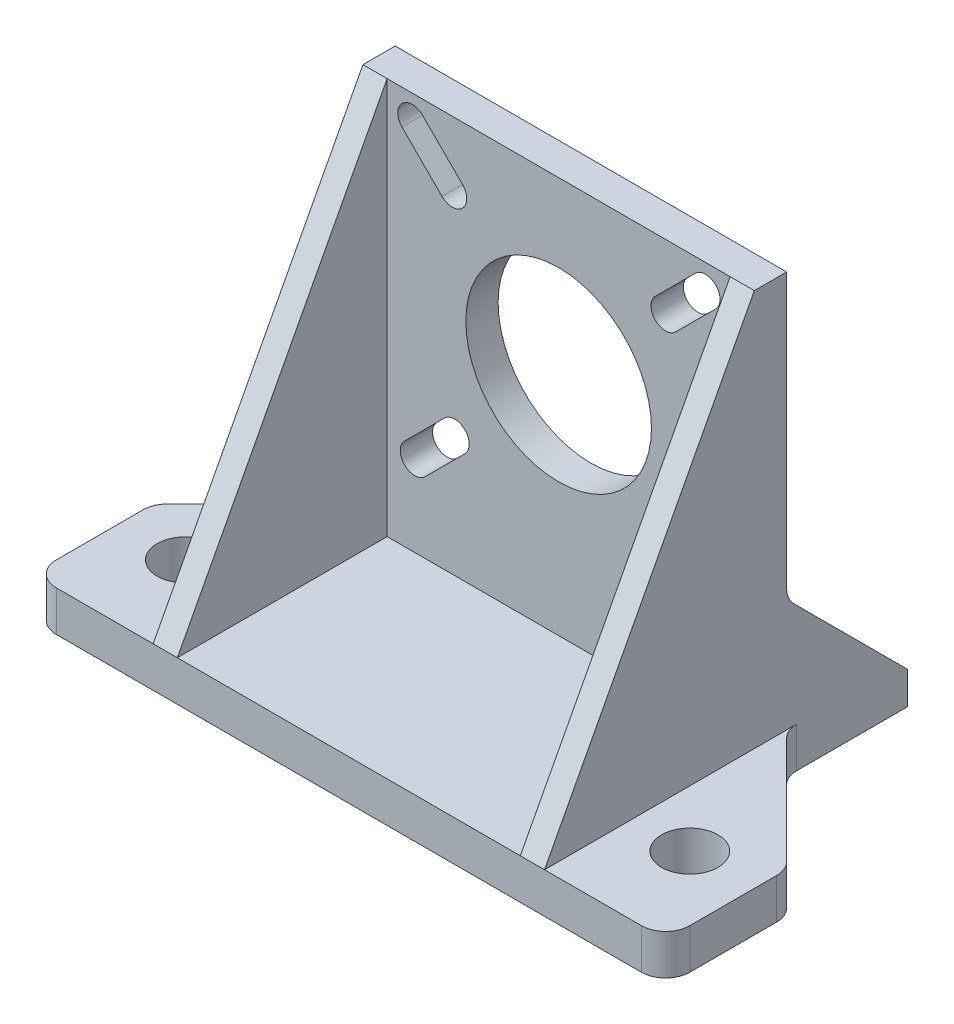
ISO-10303-21;
HEADER;
FILE_DESCRIPTION(('STEP AP214'),'2;1');
FILE_NAME('part.step','',(''),(''),'','','');
FILE_SCHEMA(('AUTOMOTIVE_DESIGN { 1 0 10303 214 1 1 1 1 }'));
ENDSEC;
DATA;
#1=APPLICATION_CONTEXT('core data for automotive mechanical design processes');
#2=APPLICATION_PROTOCOL_DEFINITION('international standard','automotive_design',2000,#1);
#3=PRODUCT_CONTEXT('',#1,'mechanical');
#4=PRODUCT('Part','Part','',(#3));
#5=PRODUCT_RELATED_PRODUCT_CATEGORY('part','',(#4));
#6=PRODUCT_DEFINITION_FORMATION('','',#4);
#7=PRODUCT_DEFINITION_CONTEXT('part definition',#1,'design');
#8=PRODUCT_DEFINITION('design','',#6,#7);
#9=PRODUCT_DEFINITION_SHAPE('','',#8);
#10=(LENGTH_UNIT() NAMED_UNIT(*) SI_UNIT(.MILLI.,.METRE.));
#11=(NAMED_UNIT(*) PLANE_ANGLE_UNIT() SI_UNIT($,.RADIAN.));
#12=(NAMED_UNIT(*) SI_UNIT($,.STERADIAN.) SOLID_ANGLE_UNIT());
#13=UNCERTAINTY_MEASURE_WITH_UNIT(LENGTH_MEASURE(1.E-05),#10,'distance_accuracy_value','');
#14=(GEOMETRIC_REPRESENTATION_CONTEXT(3) GLOBAL_UNCERTAINTY_ASSIGNED_CONTEXT((#13)) GLOBAL_UNIT_ASSIGNED_CONTEXT((#10,
#11,#12)) REPRESENTATION_CONTEXT('',''));
#15=CARTESIAN_POINT('',(0.,0.,0.));
#16=DIRECTION('',(0.,0.,1.));
#17=DIRECTION('',(1.,0.,0.));
#18=AXIS2_PLACEMENT_3D('',#15,#16,#17);
#19=CARTESIAN_POINT('',(18.,0.,0.));
#20=DIRECTION('',(-1.,0.,0.));
#21=DIRECTION('',(0.,0.,1.));
#22=AXIS2_PLACEMENT_3D('',#19,#20,#21);
#23=PLANE('',#22);
#24=DIRECTION('',(0.,-0.883940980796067,0.467598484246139));
#25=VECTOR('',#24,1.);
#26=CARTESIAN_POINT('',(18.,54.15,-26.));
#27=LINE('',#26,#25);
#28=CARTESIAN_POINT('',(18.,4.99999999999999,0.));
#29=VERTEX_POINT('',#28);
#30=CARTESIAN_POINT('',(18.,54.15,-26.));
#31=VERTEX_POINT('',#30);
#32=EDGE_CURVE('E492',#29,#31,#27,.F.);
#33=ORIENTED_EDGE('',*,*,#32,.F.);
#34=DIRECTION('',(0.,0.,-1.));
#35=VECTOR('',#34,1.);
#36=CARTESIAN_POINT('',(18.,5.,0.));
#37=LINE('',#36,#35);
#38=CARTESIAN_POINT('',(18.,5.,-26.));
#39=VERTEX_POINT('',#38);
#40=EDGE_CURVE('E480',#29,#39,#37,.T.);
#41=ORIENTED_EDGE('',*,*,#40,.T.);
#42=DIRECTION('',(0.,1.,0.));
#43=VECTOR('',#42,1.);
#44=CARTESIAN_POINT('',(18.,0.,-26.));
#45=LINE('',#44,#43);
#46=EDGE_CURVE('E505',#39,#31,#45,.T.);
#47=ORIENTED_EDGE('',*,*,#46,.T.);
#48=EDGE_LOOP('',(#33,#41,#47));
#49=FACE_BOUND('',#48,.T.);
#50=ADVANCED_FACE('F17',(#49),#23,.F.);
#51=CARTESIAN_POINT('',(0.,0.,-26.));
#52=DIRECTION('',(0.,0.,-1.));
#53=DIRECTION('',(-1.,0.,0.));
#54=AXIS2_PLACEMENT_3D('',#51,#52,#53);
#55=PLANE('',#54);
#56=DIRECTION('',(1.,0.,0.));
#57=VECTOR('',#56,1.);
#58=CARTESIAN_POINT('',(0.,5.,-26.));
#59=LINE('',#58,#57);
#60=CARTESIAN_POINT('',(60.5,5.,-26.));
#61=VERTEX_POINT('',#60);
#62=EDGE_CURVE('E481',#39,#61,#59,.T.);
#63=ORIENTED_EDGE('',*,*,#62,.T.);
#64=DIRECTION('',(0.,1.,0.));
#65=VECTOR('',#64,1.);
#66=CARTESIAN_POINT('',(60.5,0.,-26.));
#67=LINE('',#66,#65);
#68=CARTESIAN_POINT('',(60.5,54.15,-26.));
#69=VERTEX_POINT('',#68);
#70=EDGE_CURVE('E495',#69,#61,#67,.F.);
#71=ORIENTED_EDGE('',*,*,#70,.F.);
#72=DIRECTION('',(-1.,0.,0.));
#73=VECTOR('',#72,1.);
#74=CARTESIAN_POINT('',(15.,54.15,-26.));
#75=LINE('',#74,#73);
#76=EDGE_CURVE('E510',#31,#69,#75,.F.);
#77=ORIENTED_EDGE('',*,*,#76,.F.);
#78=ORIENTED_EDGE('',*,*,#46,.F.);
#79=EDGE_LOOP('',(#63,#71,#77,#78));
#80=FACE_BOUND('',#79,.T.);
#81=CARTESIAN_POINT('',(39.25,33.,-26.));
#82=DIRECTION('',(0.,0.,1.));
#83=DIRECTION('',(1.,0.,0.));
#84=AXIS2_PLACEMENT_3D('',#81,#82,#83);
#85=CIRCLE('',#84,11.5);
#86=CARTESIAN_POINT('',(50.75,33.,-26.));
#87=VERTEX_POINT('',#86);
#88=EDGE_CURVE('E401',#87,#87,#85,.F.);
#89=ORIENTED_EDGE('',*,*,#88,.T.);
#90=EDGE_LOOP('',(#89));
#91=FACE_BOUND('',#90,.T.);
#92=DIRECTION('',(-0.707106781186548,0.707106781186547,0.));
#93=VECTOR('',#92,1.);
#94=CARTESIAN_POINT('',(27.3373806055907,47.4582038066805,-26.));
#95=LINE('',#94,#93);
#96=CARTESIAN_POINT('',(22.3876331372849,52.4079512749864,-26.));
#97=VERTEX_POINT('',#96);
#98=CARTESIAN_POINT('',(27.3373806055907,47.4582038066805,-26.));
#99=VERTEX_POINT('',#98);
#100=EDGE_CURVE('E405',#97,#99,#95,.F.);
#101=ORIENTED_EDGE('',*,*,#100,.T.);
#102=CARTESIAN_POINT('',(26.064588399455,46.1854116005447,-26.));
#103=DIRECTION('',(0.,0.,1.));
#104=DIRECTION('',(1.,0.,0.));
#105=AXIS2_PLACEMENT_3D('',#102,#103,#104);
#106=CIRCLE('',#105,1.8);
#107=CARTESIAN_POINT('',(24.7917961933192,44.912619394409,-26.));
#108=VERTEX_POINT('',#107);
#109=EDGE_CURVE('E398',#99,#108,#106,.F.);
#110=ORIENTED_EDGE('',*,*,#109,.T.);
#111=DIRECTION('',(0.707106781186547,-0.707106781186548,0.));
#112=VECTOR('',#111,1.);
#113=CARTESIAN_POINT('',(24.7917961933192,44.912619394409,-26.));
#114=LINE('',#113,#112);
#115=CARTESIAN_POINT('',(19.8420487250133,49.8623668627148,-26.));
#116=VERTEX_POINT('',#115);
#117=EDGE_CURVE('E397',#108,#116,#114,.F.);
#118=ORIENTED_EDGE('',*,*,#117,.T.);
#119=CARTESIAN_POINT('',(21.1148409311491,51.1351590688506,-26.));
#120=DIRECTION('',(0.,0.,1.));
#121=DIRECTION('',(1.,0.,0.));
#122=AXIS2_PLACEMENT_3D('',#119,#120,#121);
#123=CIRCLE('',#122,1.79999999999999);
#124=EDGE_CURVE('E406',#116,#97,#123,.F.);
#125=ORIENTED_EDGE('',*,*,#124,.T.);
#126=EDGE_LOOP('',(#101,#110,#118,#125));
#127=FACE_BOUND('',#126,.T.);
#128=CARTESIAN_POINT('',(52.4978955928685,46.1229276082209,-26.));
#129=DIRECTION('',(0.,0.,1.));
#130=DIRECTION('',(1.,0.,0.));
#131=AXIS2_PLACEMENT_3D('',#128,#129,#130);
#132=CIRCLE('',#131,1.8);
#133=CARTESIAN_POINT('',(53.7706877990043,44.8501354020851,-26.));
#134=VERTEX_POINT('',#133);
#135=CARTESIAN_POINT('',(51.2251033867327,47.3957198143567,-26.));
#136=VERTEX_POINT('',#135);
#137=EDGE_CURVE('E414',#134,#136,#132,.F.);
#138=ORIENTED_EDGE('',*,*,#137,.T.);
#139=DIRECTION('',(-0.707106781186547,-0.707106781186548,0.));
#140=VECTOR('',#139,1.);
#141=CARTESIAN_POINT('',(51.2251033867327,47.3957198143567,-26.));
#142=LINE('',#141,#140);
#143=CARTESIAN_POINT('',(56.1748508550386,52.3454672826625,-26.));
#144=VERTEX_POINT('',#143);
#145=EDGE_CURVE('E413',#136,#144,#142,.F.);
#146=ORIENTED_EDGE('',*,*,#145,.T.);
#147=CARTESIAN_POINT('',(57.4476430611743,51.0726750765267,-26.));
#148=DIRECTION('',(0.,0.,1.));
#149=DIRECTION('',(1.,0.,0.));
#150=AXIS2_PLACEMENT_3D('',#147,#148,#149);
#151=CIRCLE('',#150,1.8);
#152=CARTESIAN_POINT('',(58.7204352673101,49.799882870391,-26.));
#153=VERTEX_POINT('',#152);
#154=EDGE_CURVE('E424',#144,#153,#151,.F.);
#155=ORIENTED_EDGE('',*,*,#154,.T.);
#156=DIRECTION('',(0.707106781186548,0.707106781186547,0.));
#157=VECTOR('',#156,1.);
#158=CARTESIAN_POINT('',(53.7706877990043,44.8501354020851,-26.));
#159=LINE('',#158,#157);
#160=EDGE_CURVE('E420',#153,#134,#159,.F.);
#161=ORIENTED_EDGE('',*,*,#160,.T.);
#162=EDGE_LOOP('',(#138,#146,#155,#161));
#163=FACE_BOUND('',#162,.T.);
#164=CARTESIAN_POINT('',(52.1912361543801,20.0587638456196,-26.));
#165=DIRECTION('',(0.,0.,1.));
#166=DIRECTION('',(1.,0.,0.));
#167=AXIS2_PLACEMENT_3D('',#164,#165,#166);
#168=CIRCLE('',#167,1.79999999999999);
#169=CARTESIAN_POINT('',(50.9184439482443,18.7859716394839,-26.));
#170=VERTEX_POINT('',#169);
#171=CARTESIAN_POINT('',(53.4640283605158,21.3315560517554,-26.));
#172=VERTEX_POINT('',#171);
#173=EDGE_CURVE('E429',#170,#172,#168,.F.);
#174=ORIENTED_EDGE('',*,*,#173,.T.);
#175=DIRECTION('',(-0.707106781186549,0.707106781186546,0.));
#176=VECTOR('',#175,1.);
#177=CARTESIAN_POINT('',(53.4640283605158,21.3315560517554,-26.));
#178=LINE('',#177,#176);
#179=CARTESIAN_POINT('',(58.4137758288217,16.3818085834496,-26.));
#180=VERTEX_POINT('',#179);
#181=EDGE_CURVE('E428',#172,#180,#178,.F.);
#182=ORIENTED_EDGE('',*,*,#181,.T.);
#183=CARTESIAN_POINT('',(57.1409836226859,15.1090163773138,-26.));
#184=DIRECTION('',(0.,0.,1.));
#185=DIRECTION('',(1.,0.,0.));
#186=AXIS2_PLACEMENT_3D('',#183,#184,#185);
#187=CIRCLE('',#186,1.8);
#188=CARTESIAN_POINT('',(55.8681914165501,13.836224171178,-26.));
#189=VERTEX_POINT('',#188);
#190=EDGE_CURVE('E438',#180,#189,#187,.F.);
#191=ORIENTED_EDGE('',*,*,#190,.T.);
#192=DIRECTION('',(0.707106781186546,-0.707106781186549,0.));
#193=VECTOR('',#192,1.);
#194=CARTESIAN_POINT('',(50.9184439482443,18.7859716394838,-26.));
#195=LINE('',#194,#193);
#196=EDGE_CURVE('E435',#189,#170,#195,.F.);
#197=ORIENTED_EDGE('',*,*,#196,.T.);
#198=EDGE_LOOP('',(#174,#182,#191,#197));
#199=FACE_BOUND('',#198,.T.);
#200=CARTESIAN_POINT('',(26.3712478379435,19.9962798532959,-26.));
#201=DIRECTION('',(0.,0.,1.));
#202=DIRECTION('',(1.,0.,0.));
#203=AXIS2_PLACEMENT_3D('',#200,#201,#202);
#204=CIRCLE('',#203,1.8);
#205=CARTESIAN_POINT('',(25.0984556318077,21.2690720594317,-26.));
#206=VERTEX_POINT('',#205);
#207=CARTESIAN_POINT('',(27.6440400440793,18.7234876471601,-26.));
#208=VERTEX_POINT('',#207);
#209=EDGE_CURVE('E269',#206,#208,#204,.F.);
#210=ORIENTED_EDGE('',*,*,#209,.T.);
#211=DIRECTION('',(0.707106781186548,0.707106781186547,0.));
#212=VECTOR('',#211,1.);
#213=CARTESIAN_POINT('',(27.6440400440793,18.7234876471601,-26.));
#214=LINE('',#213,#212);
#215=CARTESIAN_POINT('',(22.6942925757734,13.7737401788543,-26.));
#216=VERTEX_POINT('',#215);
#217=EDGE_CURVE('E268',#208,#216,#214,.F.);
#218=ORIENTED_EDGE('',*,*,#217,.T.);
#219=CARTESIAN_POINT('',(21.4215003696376,15.04653238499,-26.));
#220=DIRECTION('',(0.,0.,1.));
#221=DIRECTION('',(1.,0.,0.));
#222=AXIS2_PLACEMENT_3D('',#219,#220,#221);
#223=CIRCLE('',#222,1.8);
#224=CARTESIAN_POINT('',(20.1487081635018,16.3193245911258,-26.));
#225=VERTEX_POINT('',#224);
#226=EDGE_CURVE('E20',#216,#225,#223,.F.);
#227=ORIENTED_EDGE('',*,*,#226,.T.);
#228=DIRECTION('',(-0.707106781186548,-0.707106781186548,0.));
#229=VECTOR('',#228,1.);
#230=CARTESIAN_POINT('',(25.0984556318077,21.2690720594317,-26.));
#231=LINE('',#230,#229);
#232=EDGE_CURVE('E443',#225,#206,#231,.F.);
#233=ORIENTED_EDGE('',*,*,#232,.T.);
#234=EDGE_LOOP('',(#210,#218,#227,#233));
#235=FACE_BOUND('',#234,.T.);
#236=ADVANCED_FACE('F630',(#80,#91,#127,#163,#199,#235),#55,.F.);
#237=CARTESIAN_POINT('',(60.5,0.,0.));
#238=DIRECTION('',(-1.,0.,0.));
#239=DIRECTION('',(0.,0.,1.));
#240=AXIS2_PLACEMENT_3D('',#237,#238,#239);
#241=PLANE('',#240);
#242=DIRECTION('',(0.,0.,-1.));
#243=VECTOR('',#242,1.);
#244=CARTESIAN_POINT('',(60.5,5.,0.));
#245=LINE('',#244,#243);
#246=CARTESIAN_POINT('',(60.5,5.,0.));
#247=VERTEX_POINT('',#246);
#248=EDGE_CURVE('E477',#61,#247,#245,.F.);
#249=ORIENTED_EDGE('',*,*,#248,.T.);
#250=DIRECTION('',(0.,-0.883940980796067,0.467598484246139));
#251=VECTOR('',#250,1.);
#252=CARTESIAN_POINT('',(60.5,54.15,-26.));
#253=LINE('',#252,#251);
#254=EDGE_CURVE('E450',#69,#247,#253,.T.);
#255=ORIENTED_EDGE('',*,*,#254,.F.);
#256=ORIENTED_EDGE('',*,*,#70,.T.);
#257=EDGE_LOOP('',(#249,#255,#256));
#258=FACE_BOUND('',#257,.T.);
#259=ADVANCED_FACE('F1113',(#258),#241,.T.);
#260=CARTESIAN_POINT('',(18.,54.15,-26.));
#261=DIRECTION('',(0.,0.467598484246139,0.883940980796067));
#262=DIRECTION('',(0.,-0.883940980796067,0.467598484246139));
#263=AXIS2_PLACEMENT_3D('',#260,#261,#262);
#264=PLANE('',#263);
#265=ORIENTED_EDGE('',*,*,#32,.T.);
#266=DIRECTION('',(-1.,0.,0.));
#267=VECTOR('',#266,1.);
#268=CARTESIAN_POINT('',(15.,54.15,-26.));
#269=LINE('',#268,#267);
#270=CARTESIAN_POINT('',(15.,54.15,-26.));
#271=VERTEX_POINT('',#270);
#272=EDGE_CURVE('E391',#271,#31,#269,.F.);
#273=ORIENTED_EDGE('',*,*,#272,.F.);
#274=DIRECTION('',(0.,0.883940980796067,-0.467598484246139));
#275=VECTOR('',#274,1.);
#276=CARTESIAN_POINT('',(15.,5.,0.));
#277=LINE('',#276,#275);
#278=CARTESIAN_POINT('',(15.,5.,0.));
#279=VERTEX_POINT('',#278);
#280=EDGE_CURVE('E366',#279,#271,#277,.T.);
#281=ORIENTED_EDGE('',*,*,#280,.F.);
#282=DIRECTION('',(-1.,0.,0.));
#283=VECTOR('',#282,1.);
#284=CARTESIAN_POINT('',(0.,5.,0.));
#285=LINE('',#284,#283);
#286=EDGE_CURVE('E456',#279,#29,#285,.F.);
#287=ORIENTED_EDGE('',*,*,#286,.T.);
#288=EDGE_LOOP('',(#265,#273,#281,#287));
#289=FACE_BOUND('',#288,.T.);
#290=ADVANCED_FACE('F647',(#289),#264,.T.);
#291=CARTESIAN_POINT('',(0.,5.,0.));
#292=DIRECTION('',(0.,-1.,0.));
#293=DIRECTION('',(0.,0.,-1.));
#294=AXIS2_PLACEMENT_3D('',#291,#292,#293);
#295=PLANE('',#294);
#296=DIRECTION('',(-1.,0.,0.));
#297=VECTOR('',#296,1.);
#298=CARTESIAN_POINT('',(0.,5.,0.));
#299=LINE('',#298,#297);
#300=EDGE_CURVE('E465',#29,#247,#299,.F.);
#301=ORIENTED_EDGE('',*,*,#300,.T.);
#302=ORIENTED_EDGE('',*,*,#248,.F.);
#303=ORIENTED_EDGE('',*,*,#62,.F.);
#304=ORIENTED_EDGE('',*,*,#40,.F.);
#305=EDGE_LOOP('',(#301,#302,#303,#304));
#306=FACE_BOUND('',#305,.T.);
#307=ADVANCED_FACE('F639',(#306),#295,.F.);
#308=CARTESIAN_POINT('',(21.4215003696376,15.04653238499,-36.));
#309=DIRECTION('',(0.,0.,1.));
#310=DIRECTION('',(1.,0.,0.));
#311=AXIS2_PLACEMENT_3D('',#308,#309,#310);
#312=CYLINDRICAL_SURFACE('',#311,1.8);
#313=ORIENTED_EDGE('',*,*,#226,.F.);
#314=DIRECTION('',(0.,0.,1.));
#315=VECTOR('',#314,1.);
#316=CARTESIAN_POINT('',(22.6942925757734,13.7737401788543,-36.));
#317=LINE('',#316,#315);
#318=CARTESIAN_POINT('',(22.6942925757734,13.7737401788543,-30.));
#319=VERTEX_POINT('',#318);
#320=EDGE_CURVE('E440',#216,#319,#317,.F.);
#321=ORIENTED_EDGE('',*,*,#320,.T.);
#322=CARTESIAN_POINT('',(21.4215003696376,15.04653238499,-30.));
#323=DIRECTION('',(0.,0.,1.));
#324=DIRECTION('',(1.,0.,0.));
#325=AXIS2_PLACEMENT_3D('',#322,#323,#324);
#326=CIRCLE('',#325,1.8);
#327=CARTESIAN_POINT('',(20.1487081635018,16.3193245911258,-30.));
#328=VERTEX_POINT('',#327);
#329=EDGE_CURVE('E272',#319,#328,#326,.F.);
#330=ORIENTED_EDGE('',*,*,#329,.T.);
#331=DIRECTION('',(0.,0.,1.));
#332=VECTOR('',#331,1.);
#333=CARTESIAN_POINT('',(20.1487081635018,16.3193245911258,-36.));
#334=LINE('',#333,#332);
#335=EDGE_CURVE('E444',#328,#225,#334,.T.);
#336=ORIENTED_EDGE('',*,*,#335,.T.);
#337=EDGE_LOOP('',(#313,#321,#330,#336));
#338=FACE_BOUND('',#337,.T.);
#339=ADVANCED_FACE('F637',(#338),#312,.F.);
#340=CARTESIAN_POINT('',(25.0984556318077,21.2690720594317,-36.));
#341=DIRECTION('',(-0.707106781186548,0.707106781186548,0.));
#342=DIRECTION('',(-0.707106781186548,-0.707106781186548,0.));
#343=AXIS2_PLACEMENT_3D('',#340,#341,#342);
#344=PLANE('',#343);
#345=ORIENTED_EDGE('',*,*,#232,.F.);
#346=ORIENTED_EDGE('',*,*,#335,.F.);
#347=DIRECTION('',(0.707106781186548,0.707106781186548,0.));
#348=VECTOR('',#347,1.);
#349=CARTESIAN_POINT('',(20.1487081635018,16.3193245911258,-30.));
#350=LINE('',#349,#348);
#351=CARTESIAN_POINT('',(25.0984556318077,21.2690720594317,-30.));
#352=VERTEX_POINT('',#351);
#353=EDGE_CURVE('E261',#328,#352,#350,.T.);
#354=ORIENTED_EDGE('',*,*,#353,.T.);
#355=DIRECTION('',(0.,0.,1.));
#356=VECTOR('',#355,1.);
#357=CARTESIAN_POINT('',(25.0984556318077,21.2690720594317,-36.));
#358=LINE('',#357,#356);
#359=EDGE_CURVE('E256',#352,#206,#358,.T.);
#360=ORIENTED_EDGE('',*,*,#359,.T.);
#361=EDGE_LOOP('',(#345,#346,#354,#360));
#362=FACE_BOUND('',#361,.T.);
#363=ADVANCED_FACE('F635',(#362),#344,.F.);
#364=CARTESIAN_POINT('',(26.3712478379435,19.9962798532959,-36.));
#365=DIRECTION('',(0.,0.,1.));
#366=DIRECTION('',(1.,0.,0.));
#367=AXIS2_PLACEMENT_3D('',#364,#365,#366);
#368=CYLINDRICAL_SURFACE('',#367,1.8);
#369=CARTESIAN_POINT('',(26.3712478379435,19.9962798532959,-30.));
#370=DIRECTION('',(0.,0.,1.));
#371=DIRECTION('',(1.,0.,0.));
#372=AXIS2_PLACEMENT_3D('',#369,#370,#371);
#373=CIRCLE('',#372,1.8);
#374=CARTESIAN_POINT('',(27.6440400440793,18.7234876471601,-30.));
#375=VERTEX_POINT('',#374);
#376=EDGE_CURVE('E249',#352,#375,#373,.F.);
#377=ORIENTED_EDGE('',*,*,#376,.T.);
#378=DIRECTION('',(0.,0.,1.));
#379=VECTOR('',#378,1.);
#380=CARTESIAN_POINT('',(27.6440400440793,18.7234876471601,-36.));
#381=LINE('',#380,#379);
#382=EDGE_CURVE('E253',#375,#208,#381,.T.);
#383=ORIENTED_EDGE('',*,*,#382,.T.);
#384=ORIENTED_EDGE('',*,*,#209,.F.);
#385=ORIENTED_EDGE('',*,*,#359,.F.);
#386=EDGE_LOOP('',(#377,#383,#384,#385));
#387=FACE_BOUND('',#386,.T.);
#388=ADVANCED_FACE('F251',(#387),#368,.F.);
#389=CARTESIAN_POINT('',(27.6440400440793,18.7234876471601,-36.));
#390=DIRECTION('',(0.707106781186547,-0.707106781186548,0.));
#391=DIRECTION('',(0.707106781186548,0.707106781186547,0.));
#392=AXIS2_PLACEMENT_3D('',#389,#390,#391);
#393=PLANE('',#392);
#394=ORIENTED_EDGE('',*,*,#217,.F.);
#395=ORIENTED_EDGE('',*,*,#382,.F.);
#396=DIRECTION('',(-0.707106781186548,-0.707106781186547,0.));
#397=VECTOR('',#396,1.);
#398=CARTESIAN_POINT('',(27.6440400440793,18.7234876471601,-30.));
#399=LINE('',#398,#397);
#400=EDGE_CURVE('E260',#375,#319,#399,.T.);
#401=ORIENTED_EDGE('',*,*,#400,.T.);
#402=ORIENTED_EDGE('',*,*,#320,.F.);
#403=EDGE_LOOP('',(#394,#395,#401,#402));
#404=FACE_BOUND('',#403,.T.);
#405=ADVANCED_FACE('F265',(#404),#393,.F.);
#406=CARTESIAN_POINT('',(57.1409836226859,15.1090163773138,-36.));
#407=DIRECTION('',(0.,0.,1.));
#408=DIRECTION('',(1.,0.,0.));
#409=AXIS2_PLACEMENT_3D('',#406,#407,#408);
#410=CYLINDRICAL_SURFACE('',#409,1.8);
#411=CARTESIAN_POINT('',(57.1409836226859,15.1090163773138,-30.));
#412=DIRECTION('',(0.,0.,1.));
#413=DIRECTION('',(1.,0.,0.));
#414=AXIS2_PLACEMENT_3D('',#411,#412,#413);
#415=CIRCLE('',#414,1.8);
#416=CARTESIAN_POINT('',(58.4137758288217,16.3818085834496,-30.));
#417=VERTEX_POINT('',#416);
#418=CARTESIAN_POINT('',(55.8681914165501,13.836224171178,-30.));
#419=VERTEX_POINT('',#418);
#420=EDGE_CURVE('E242',#417,#419,#415,.F.);
#421=ORIENTED_EDGE('',*,*,#420,.T.);
#422=DIRECTION('',(0.,0.,1.));
#423=VECTOR('',#422,1.);
#424=CARTESIAN_POINT('',(55.8681914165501,13.836224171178,-36.));
#425=LINE('',#424,#423);
#426=EDGE_CURVE('E436',#419,#189,#425,.T.);
#427=ORIENTED_EDGE('',*,*,#426,.T.);
#428=ORIENTED_EDGE('',*,*,#190,.F.);
#429=DIRECTION('',(0.,0.,1.));
#430=VECTOR('',#429,1.);
#431=CARTESIAN_POINT('',(58.4137758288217,16.3818085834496,-36.));
#432=LINE('',#431,#430);
#433=EDGE_CURVE('E430',#180,#417,#432,.F.);
#434=ORIENTED_EDGE('',*,*,#433,.T.);
#435=EDGE_LOOP('',(#421,#427,#428,#434));
#436=FACE_BOUND('',#435,.T.);
#437=ADVANCED_FACE('F815',(#436),#410,.F.);
#438=CARTESIAN_POINT('',(50.9184439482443,18.7859716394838,-36.));
#439=DIRECTION('',(-0.707106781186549,-0.707106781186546,0.));
#440=DIRECTION('',(0.707106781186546,-0.707106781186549,0.));
#441=AXIS2_PLACEMENT_3D('',#438,#439,#440);
#442=PLANE('',#441);
#443=ORIENTED_EDGE('',*,*,#196,.F.);
#444=ORIENTED_EDGE('',*,*,#426,.F.);
#445=DIRECTION('',(-0.707106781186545,0.70710678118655,0.));
#446=VECTOR('',#445,1.);
#447=CARTESIAN_POINT('',(55.8681914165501,13.836224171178,-30.));
#448=LINE('',#447,#446);
#449=CARTESIAN_POINT('',(50.9184439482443,18.7859716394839,-30.));
#450=VERTEX_POINT('',#449);
#451=EDGE_CURVE('E274',#419,#450,#448,.T.);
#452=ORIENTED_EDGE('',*,*,#451,.T.);
#453=DIRECTION('',(0.,0.,1.));
#454=VECTOR('',#453,1.);
#455=CARTESIAN_POINT('',(50.9184439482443,18.7859716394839,-36.));
#456=LINE('',#455,#454);
#457=EDGE_CURVE('E432',#450,#170,#456,.T.);
#458=ORIENTED_EDGE('',*,*,#457,.T.);
#459=EDGE_LOOP('',(#443,#444,#452,#458));
#460=FACE_BOUND('',#459,.T.);
#461=ADVANCED_FACE('F811',(#460),#442,.F.);
#462=CARTESIAN_POINT('',(52.1912361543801,20.0587638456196,-36.));
#463=DIRECTION('',(0.,0.,1.));
#464=DIRECTION('',(1.,0.,0.));
#465=AXIS2_PLACEMENT_3D('',#462,#463,#464);
#466=CYLINDRICAL_SURFACE('',#465,1.79999999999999);
#467=ORIENTED_EDGE('',*,*,#173,.F.);
#468=ORIENTED_EDGE('',*,*,#457,.F.);
#469=CARTESIAN_POINT('',(52.1912361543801,20.0587638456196,-30.));
#470=DIRECTION('',(0.,0.,1.));
#471=DIRECTION('',(1.,0.,0.));
#472=AXIS2_PLACEMENT_3D('',#469,#470,#471);
#473=CIRCLE('',#472,1.79999999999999);
#474=CARTESIAN_POINT('',(53.4640283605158,21.3315560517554,-30.));
#475=VERTEX_POINT('',#474);
#476=EDGE_CURVE('E608',#450,#475,#473,.F.);
#477=ORIENTED_EDGE('',*,*,#476,.T.);
#478=DIRECTION('',(0.,0.,1.));
#479=VECTOR('',#478,1.);
#480=CARTESIAN_POINT('',(53.4640283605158,21.3315560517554,-36.));
#481=LINE('',#480,#479);
#482=EDGE_CURVE('E425',#475,#172,#481,.T.);
#483=ORIENTED_EDGE('',*,*,#482,.T.);
#484=EDGE_LOOP('',(#467,#468,#477,#483));
#485=FACE_BOUND('',#484,.T.);
#486=ADVANCED_FACE('F807',(#485),#466,.F.);
#487=CARTESIAN_POINT('',(53.4640283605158,21.3315560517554,-36.));
#488=DIRECTION('',(0.707106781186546,0.707106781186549,0.));
#489=DIRECTION('',(-0.707106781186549,0.707106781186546,0.));
#490=AXIS2_PLACEMENT_3D('',#487,#488,#489);
#491=PLANE('',#490);
#492=ORIENTED_EDGE('',*,*,#181,.F.);
#493=ORIENTED_EDGE('',*,*,#482,.F.);
#494=DIRECTION('',(0.707106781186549,-0.707106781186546,0.));
#495=VECTOR('',#494,1.);
#496=CARTESIAN_POINT('',(53.4640283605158,21.3315560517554,-30.));
#497=LINE('',#496,#495);
#498=EDGE_CURVE('E607',#475,#417,#497,.T.);
#499=ORIENTED_EDGE('',*,*,#498,.T.);
#500=ORIENTED_EDGE('',*,*,#433,.F.);
#501=EDGE_LOOP('',(#492,#493,#499,#500));
#502=FACE_BOUND('',#501,.T.);
#503=ADVANCED_FACE('F803',(#502),#491,.F.);
#504=CARTESIAN_POINT('',(57.4476430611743,51.0726750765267,-36.));
#505=DIRECTION('',(0.,0.,1.));
#506=DIRECTION('',(1.,0.,0.));
#507=AXIS2_PLACEMENT_3D('',#504,#505,#506);
#508=CYLINDRICAL_SURFACE('',#507,1.8);
#509=CARTESIAN_POINT('',(57.4476430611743,51.0726750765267,-30.));
#510=DIRECTION('',(0.,0.,1.));
#511=DIRECTION('',(1.,0.,0.));
#512=AXIS2_PLACEMENT_3D('',#509,#510,#511);
#513=CIRCLE('',#512,1.8);
#514=CARTESIAN_POINT('',(56.1748508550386,52.3454672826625,-30.));
#515=VERTEX_POINT('',#514);
#516=CARTESIAN_POINT('',(58.7204352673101,49.799882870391,-30.));
#517=VERTEX_POINT('',#516);
#518=EDGE_CURVE('E605',#515,#517,#513,.F.);
#519=ORIENTED_EDGE('',*,*,#518,.T.);
#520=DIRECTION('',(0.,0.,1.));
#521=VECTOR('',#520,1.);
#522=CARTESIAN_POINT('',(58.7204352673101,49.799882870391,-36.));
#523=LINE('',#522,#521);
#524=EDGE_CURVE('E421',#517,#153,#523,.T.);
#525=ORIENTED_EDGE('',*,*,#524,.T.);
#526=ORIENTED_EDGE('',*,*,#154,.F.);
#527=DIRECTION('',(0.,0.,1.));
#528=VECTOR('',#527,1.);
#529=CARTESIAN_POINT('',(56.1748508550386,52.3454672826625,-36.));
#530=LINE('',#529,#528);
#531=EDGE_CURVE('E415',#144,#515,#530,.F.);
#532=ORIENTED_EDGE('',*,*,#531,.T.);
#533=EDGE_LOOP('',(#519,#525,#526,#532));
#534=FACE_BOUND('',#533,.T.);
#535=ADVANCED_FACE('F799',(#534),#508,.F.);
#536=CARTESIAN_POINT('',(53.7706877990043,44.8501354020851,-36.));
#537=DIRECTION('',(0.707106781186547,-0.707106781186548,0.));
#538=DIRECTION('',(0.707106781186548,0.707106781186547,0.));
#539=AXIS2_PLACEMENT_3D('',#536,#537,#538);
#540=PLANE('',#539);
#541=ORIENTED_EDGE('',*,*,#160,.F.);
#542=ORIENTED_EDGE('',*,*,#524,.F.);
#543=DIRECTION('',(-0.707106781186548,-0.707106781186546,0.));
#544=VECTOR('',#543,1.);
#545=CARTESIAN_POINT('',(58.7204352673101,49.799882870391,-30.));
#546=LINE('',#545,#544);
#547=CARTESIAN_POINT('',(53.7706877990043,44.8501354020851,-30.));
#548=VERTEX_POINT('',#547);
#549=EDGE_CURVE('E604',#517,#548,#546,.T.);
#550=ORIENTED_EDGE('',*,*,#549,.T.);
#551=DIRECTION('',(0.,0.,1.));
#552=VECTOR('',#551,1.);
#553=CARTESIAN_POINT('',(53.7706877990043,44.8501354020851,-36.));
#554=LINE('',#553,#552);
#555=EDGE_CURVE('E417',#548,#134,#554,.T.);
#556=ORIENTED_EDGE('',*,*,#555,.T.);
#557=EDGE_LOOP('',(#541,#542,#550,#556));
#558=FACE_BOUND('',#557,.T.);
#559=ADVANCED_FACE('F795',(#558),#540,.F.);
#560=CARTESIAN_POINT('',(52.4978955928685,46.1229276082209,-36.));
#561=DIRECTION('',(0.,0.,1.));
#562=DIRECTION('',(1.,0.,0.));
#563=AXIS2_PLACEMENT_3D('',#560,#561,#562);
#564=CYLINDRICAL_SURFACE('',#563,1.8);
#565=ORIENTED_EDGE('',*,*,#137,.F.);
#566=ORIENTED_EDGE('',*,*,#555,.F.);
#567=CARTESIAN_POINT('',(52.4978955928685,46.1229276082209,-30.));
#568=DIRECTION('',(0.,0.,1.));
#569=DIRECTION('',(1.,0.,0.));
#570=AXIS2_PLACEMENT_3D('',#567,#568,#569);
#571=CIRCLE('',#570,1.8);
#572=CARTESIAN_POINT('',(51.2251033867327,47.3957198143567,-30.));
#573=VERTEX_POINT('',#572);
#574=EDGE_CURVE('E602',#548,#573,#571,.F.);
#575=ORIENTED_EDGE('',*,*,#574,.T.);
#576=DIRECTION('',(0.,0.,1.));
#577=VECTOR('',#576,1.);
#578=CARTESIAN_POINT('',(51.2251033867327,47.3957198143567,-36.));
#579=LINE('',#578,#577);
#580=EDGE_CURVE('E410',#573,#136,#579,.T.);
#581=ORIENTED_EDGE('',*,*,#580,.T.);
#582=EDGE_LOOP('',(#565,#566,#575,#581));
#583=FACE_BOUND('',#582,.T.);
#584=ADVANCED_FACE('F791',(#583),#564,.F.);
#585=CARTESIAN_POINT('',(51.2251033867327,47.3957198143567,-36.));
#586=DIRECTION('',(-0.707106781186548,0.707106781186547,0.));
#587=DIRECTION('',(-0.707106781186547,-0.707106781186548,0.));
#588=AXIS2_PLACEMENT_3D('',#585,#586,#587);
#589=PLANE('',#588);
#590=ORIENTED_EDGE('',*,*,#145,.F.);
#591=ORIENTED_EDGE('',*,*,#580,.F.);
#592=DIRECTION('',(0.707106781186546,0.707106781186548,0.));
#593=VECTOR('',#592,1.);
#594=CARTESIAN_POINT('',(51.2251033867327,47.3957198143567,-30.));
#595=LINE('',#594,#593);
#596=EDGE_CURVE('E601',#573,#515,#595,.T.);
#597=ORIENTED_EDGE('',*,*,#596,.T.);
#598=ORIENTED_EDGE('',*,*,#531,.F.);
#599=EDGE_LOOP('',(#590,#591,#597,#598));
#600=FACE_BOUND('',#599,.T.);
#601=ADVANCED_FACE('F787',(#600),#589,.F.);
#602=CARTESIAN_POINT('',(21.1148409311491,51.1351590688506,-36.));
#603=DIRECTION('',(0.,0.,1.));
#604=DIRECTION('',(1.,0.,0.));
#605=AXIS2_PLACEMENT_3D('',#602,#603,#604);
#606=CYLINDRICAL_SURFACE('',#605,1.79999999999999);
#607=ORIENTED_EDGE('',*,*,#124,.F.);
#608=DIRECTION('',(0.,0.,1.));
#609=VECTOR('',#608,1.);
#610=CARTESIAN_POINT('',(19.8420487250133,49.8623668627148,-36.));
#611=LINE('',#610,#609);
#612=CARTESIAN_POINT('',(19.8420487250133,49.8623668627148,-30.));
#613=VERTEX_POINT('',#612);
#614=EDGE_CURVE('E399',#116,#613,#611,.F.);
#615=ORIENTED_EDGE('',*,*,#614,.T.);
#616=CARTESIAN_POINT('',(21.1148409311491,51.1351590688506,-30.));
#617=DIRECTION('',(0.,0.,1.));
#618=DIRECTION('',(1.,0.,0.));
#619=AXIS2_PLACEMENT_3D('',#616,#617,#618);
#620=CIRCLE('',#619,1.79999999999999);
#621=CARTESIAN_POINT('',(22.3876331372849,52.4079512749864,-30.));
#622=VERTEX_POINT('',#621);
#623=EDGE_CURVE('E599',#613,#622,#620,.F.);
#624=ORIENTED_EDGE('',*,*,#623,.T.);
#625=DIRECTION('',(0.,0.,1.));
#626=VECTOR('',#625,1.);
#627=CARTESIAN_POINT('',(22.3876331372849,52.4079512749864,-36.));
#628=LINE('',#627,#626);
#629=EDGE_CURVE('E402',#622,#97,#628,.T.);
#630=ORIENTED_EDGE('',*,*,#629,.T.);
#631=EDGE_LOOP('',(#607,#615,#624,#630));
#632=FACE_BOUND('',#631,.T.);
#633=ADVANCED_FACE('F783',(#632),#606,.F.);
#634=CARTESIAN_POINT('',(27.3373806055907,47.4582038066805,-36.));
#635=DIRECTION('',(0.707106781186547,0.707106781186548,0.));
#636=DIRECTION('',(-0.707106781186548,0.707106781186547,0.));
#637=AXIS2_PLACEMENT_3D('',#634,#635,#636);
#638=PLANE('',#637);
#639=ORIENTED_EDGE('',*,*,#100,.F.);
#640=ORIENTED_EDGE('',*,*,#629,.F.);
#641=DIRECTION('',(0.707106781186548,-0.707106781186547,0.));
#642=VECTOR('',#641,1.);
#643=CARTESIAN_POINT('',(22.3876331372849,52.4079512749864,-30.));
#644=LINE('',#643,#642);
#645=CARTESIAN_POINT('',(27.3373806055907,47.4582038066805,-30.));
#646=VERTEX_POINT('',#645);
#647=EDGE_CURVE('E598',#622,#646,#644,.T.);
#648=ORIENTED_EDGE('',*,*,#647,.T.);
#649=DIRECTION('',(0.,0.,1.));
#650=VECTOR('',#649,1.);
#651=CARTESIAN_POINT('',(27.3373806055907,47.4582038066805,-36.));
#652=LINE('',#651,#650);
#653=EDGE_CURVE('E407',#99,#646,#652,.F.);
#654=ORIENTED_EDGE('',*,*,#653,.F.);
#655=EDGE_LOOP('',(#639,#640,#648,#654));
#656=FACE_BOUND('',#655,.T.);
#657=ADVANCED_FACE('F779',(#656),#638,.F.);
#658=CARTESIAN_POINT('',(26.064588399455,46.1854116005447,-36.));
#659=DIRECTION('',(0.,0.,1.));
#660=DIRECTION('',(1.,0.,0.));
#661=AXIS2_PLACEMENT_3D('',#658,#659,#660);
#662=CYLINDRICAL_SURFACE('',#661,1.8);
#663=CARTESIAN_POINT('',(26.064588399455,46.1854116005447,-30.));
#664=DIRECTION('',(0.,0.,1.));
#665=DIRECTION('',(1.,0.,0.));
#666=AXIS2_PLACEMENT_3D('',#663,#664,#665);
#667=CIRCLE('',#666,1.8);
#668=CARTESIAN_POINT('',(24.7917961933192,44.912619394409,-30.));
#669=VERTEX_POINT('',#668);
#670=EDGE_CURVE('E596',#646,#669,#667,.F.);
#671=ORIENTED_EDGE('',*,*,#670,.T.);
#672=DIRECTION('',(0.,0.,1.));
#673=VECTOR('',#672,1.);
#674=CARTESIAN_POINT('',(24.7917961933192,44.912619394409,-36.));
#675=LINE('',#674,#673);
#676=EDGE_CURVE('E394',#669,#108,#675,.T.);
#677=ORIENTED_EDGE('',*,*,#676,.T.);
#678=ORIENTED_EDGE('',*,*,#109,.F.);
#679=ORIENTED_EDGE('',*,*,#653,.T.);
#680=EDGE_LOOP('',(#671,#677,#678,#679));
#681=FACE_BOUND('',#680,.T.);
#682=ADVANCED_FACE('F775',(#681),#662,.F.);
#683=CARTESIAN_POINT('',(24.7917961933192,44.912619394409,-36.));
#684=DIRECTION('',(-0.707106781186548,-0.707106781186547,0.));
#685=DIRECTION('',(0.707106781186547,-0.707106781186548,0.));
#686=AXIS2_PLACEMENT_3D('',#683,#684,#685);
#687=PLANE('',#686);
#688=ORIENTED_EDGE('',*,*,#117,.F.);
#689=ORIENTED_EDGE('',*,*,#676,.F.);
#690=DIRECTION('',(-0.707106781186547,0.707106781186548,0.));
#691=VECTOR('',#690,1.);
#692=CARTESIAN_POINT('',(24.7917961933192,44.912619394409,-30.));
#693=LINE('',#692,#691);
#694=EDGE_CURVE('E595',#669,#613,#693,.T.);
#695=ORIENTED_EDGE('',*,*,#694,.T.);
#696=ORIENTED_EDGE('',*,*,#614,.F.);
#697=EDGE_LOOP('',(#688,#689,#695,#696));
#698=FACE_BOUND('',#697,.T.);
#699=ADVANCED_FACE('F771',(#698),#687,.F.);
#700=CARTESIAN_POINT('',(39.25,33.,-36.));
#701=DIRECTION('',(0.,0.,1.));
#702=DIRECTION('',(1.,0.,0.));
#703=AXIS2_PLACEMENT_3D('',#700,#701,#702);
#704=CYLINDRICAL_SURFACE('',#703,11.5);
#705=CARTESIAN_POINT('',(39.25,33.,-30.));
#706=DIRECTION('',(0.,0.,1.));
#707=DIRECTION('',(1.,0.,0.));
#708=AXIS2_PLACEMENT_3D('',#705,#706,#707);
#709=CIRCLE('',#708,11.5);
#710=CARTESIAN_POINT('',(50.75,33.,-30.));
#711=VERTEX_POINT('',#710);
#712=EDGE_CURVE('E379',#711,#711,#709,.F.);
#713=ORIENTED_EDGE('',*,*,#712,.T.);
#714=EDGE_LOOP('',(#713));
#715=FACE_BOUND('',#714,.T.);
#716=ORIENTED_EDGE('',*,*,#88,.F.);
#717=EDGE_LOOP('',(#716));
#718=FACE_BOUND('',#717,.T.);
#719=ADVANCED_FACE('F767',(#715,#718),#704,.F.);
#720=CARTESIAN_POINT('',(61.,0.,0.));
#721=DIRECTION('',(1.,0.,0.));
#722=DIRECTION('',(0.,0.,-1.));
#723=AXIS2_PLACEMENT_3D('',#720,#721,#722);
#724=PLANE('',#723);
#725=DIRECTION('',(0.,0.,1.));
#726=VECTOR('',#725,1.);
#727=CARTESIAN_POINT('',(61.,3.99999999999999,-45.));
#728=LINE('',#727,#726);
#729=CARTESIAN_POINT('',(61.,4.,-45.));
#730=VERTEX_POINT('',#729);
#731=CARTESIAN_POINT('',(61.,4.,-30.));
#732=VERTEX_POINT('',#731);
#733=EDGE_CURVE('E356',#730,#732,#728,.T.);
#734=ORIENTED_EDGE('',*,*,#733,.T.);
#735=DIRECTION('',(0.,1.,0.));
#736=VECTOR('',#735,1.);
#737=CARTESIAN_POINT('',(61.,5.,-30.));
#738=LINE('',#737,#736);
#739=CARTESIAN_POINT('',(61.,20.2426406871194,-30.));
#740=VERTEX_POINT('',#739);
#741=EDGE_CURVE('E328',#732,#740,#738,.T.);
#742=ORIENTED_EDGE('',*,*,#741,.T.);
#743=CARTESIAN_POINT('',(61.,20.2426406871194,-33.));
#744=DIRECTION('',(1.,0.,0.));
#745=DIRECTION('',(0.,0.,-1.));
#746=AXIS2_PLACEMENT_3D('',#743,#744,#745);
#747=CIRCLE('',#746,3.);
#748=CARTESIAN_POINT('',(61.,18.1213203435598,-30.8786796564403));
#749=VERTEX_POINT('',#748);
#750=EDGE_CURVE('E343',#740,#749,#747,.T.);
#751=ORIENTED_EDGE('',*,*,#750,.T.);
#752=DIRECTION('',(0.,-0.707106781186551,-0.707106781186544));
#753=VECTOR('',#752,1.);
#754=CARTESIAN_POINT('',(61.,3.99999999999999,-45.));
#755=LINE('',#754,#753);
#756=EDGE_CURVE('E353',#749,#730,#755,.T.);
#757=ORIENTED_EDGE('',*,*,#756,.T.);
#758=EDGE_LOOP('',(#734,#742,#751,#757));
#759=FACE_BOUND('',#758,.T.);
#760=ADVANCED_FACE('F763',(#759),#724,.F.);
#761=CARTESIAN_POINT('',(15.,0.,-26.));
#762=DIRECTION('',(-1.,0.,0.));
#763=DIRECTION('',(0.,0.,1.));
#764=AXIS2_PLACEMENT_3D('',#761,#762,#763);
#765=PLANE('',#764);
#766=DIRECTION('',(0.,0.,1.));
#767=VECTOR('',#766,1.);
#768=CARTESIAN_POINT('',(15.,54.15,-26.));
#769=LINE('',#768,#767);
#770=CARTESIAN_POINT('',(15.,54.15,-30.));
#771=VERTEX_POINT('',#770);
#772=EDGE_CURVE('E342',#771,#271,#769,.T.);
#773=ORIENTED_EDGE('',*,*,#772,.F.);
#774=DIRECTION('',(0.,1.,0.));
#775=VECTOR('',#774,1.);
#776=CARTESIAN_POINT('',(15.,5.,-30.));
#777=LINE('',#776,#775);
#778=CARTESIAN_POINT('',(15.,5.,-30.));
#779=VERTEX_POINT('',#778);
#780=EDGE_CURVE('E284',#771,#779,#777,.F.);
#781=ORIENTED_EDGE('',*,*,#780,.T.);
#782=DIRECTION('',(0.,0.,-1.));
#783=VECTOR('',#782,1.);
#784=CARTESIAN_POINT('',(15.,5.,0.));
#785=LINE('',#784,#783);
#786=EDGE_CURVE('E447',#779,#279,#785,.F.);
#787=ORIENTED_EDGE('',*,*,#786,.T.);
#788=ORIENTED_EDGE('',*,*,#280,.T.);
#789=EDGE_LOOP('',(#773,#781,#787,#788));
#790=FACE_BOUND('',#789,.T.);
#791=ADVANCED_FACE('F759',(#790),#765,.T.);
#792=CARTESIAN_POINT('',(41.,4.,-45.));
#793=DIRECTION('',(0.,-1.,0.));
#794=DIRECTION('',(1.,0.,0.));
#795=AXIS2_PLACEMENT_3D('',#792,#793,#794);
#796=PLANE('',#795);
#797=CARTESIAN_POINT('',(42.2426406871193,4.,-42.));
#798=DIRECTION('',(0.,1.,0.));
#799=DIRECTION('',(-1.,0.,0.));
#800=AXIS2_PLACEMENT_3D('',#797,#798,#799);
#801=CIRCLE('',#800,3.);
#802=CARTESIAN_POINT('',(40.1213203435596,4.,-44.1213203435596));
#803=VERTEX_POINT('',#802);
#804=CARTESIAN_POINT('',(42.2426406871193,4.,-45.));
#805=VERTEX_POINT('',#804);
#806=EDGE_CURVE('E588',#803,#805,#801,.F.);
#807=ORIENTED_EDGE('',*,*,#806,.F.);
#808=DIRECTION('',(-0.707106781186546,0.,0.707106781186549));
#809=VECTOR('',#808,1.);
#810=CARTESIAN_POINT('',(41.,4.,-45.));
#811=LINE('',#810,#809);
#812=CARTESIAN_POINT('',(26.8786796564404,4.,-30.8786796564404));
#813=VERTEX_POINT('',#812);
#814=EDGE_CURVE('E369',#813,#803,#811,.F.);
#815=ORIENTED_EDGE('',*,*,#814,.F.);
#816=CARTESIAN_POINT('',(24.7573593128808,4.00000000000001,-33.));
#817=DIRECTION('',(0.,-1.,0.));
#818=DIRECTION('',(1.,0.,0.));
#819=AXIS2_PLACEMENT_3D('',#816,#817,#818);
#820=CIRCLE('',#819,3.);
#821=CARTESIAN_POINT('',(24.7573593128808,4.00000000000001,-30.));
#822=VERTEX_POINT('',#821);
#823=EDGE_CURVE('E590',#813,#822,#820,.T.);
#824=ORIENTED_EDGE('',*,*,#823,.T.);
#825=DIRECTION('',(1.,0.,0.));
#826=VECTOR('',#825,1.);
#827=CARTESIAN_POINT('',(0.,4.,-30.));
#828=LINE('',#827,#826);
#829=EDGE_CURVE('E283',#822,#732,#828,.T.);
#830=ORIENTED_EDGE('',*,*,#829,.T.);
#831=ORIENTED_EDGE('',*,*,#733,.F.);
#832=DIRECTION('',(-1.,0.,0.));
#833=VECTOR('',#832,1.);
#834=CARTESIAN_POINT('',(0.,4.,-45.));
#835=LINE('',#834,#833);
#836=EDGE_CURVE('E346',#805,#730,#835,.F.);
#837=ORIENTED_EDGE('',*,*,#836,.F.);
#838=EDGE_LOOP('',(#807,#815,#824,#830,#831,#837));
#839=FACE_BOUND('',#838,.T.);
#840=CARTESIAN_POINT('',(51.,4.,-38.));
#841=DIRECTION('',(0.,1.,0.));
#842=DIRECTION('',(-1.,0.,0.));
#843=AXIS2_PLACEMENT_3D('',#840,#841,#842);
#844=CIRCLE('',#843,3.5);
#845=CARTESIAN_POINT('',(47.5,4.,-38.));
#846=VERTEX_POINT('',#845);
#847=EDGE_CURVE('E318',#846,#846,#844,.F.);
#848=ORIENTED_EDGE('',*,*,#847,.T.);
#849=EDGE_LOOP('',(#848));
#850=FACE_BOUND('',#849,.T.);
#851=ADVANCED_FACE('F755',(#839,#850),#796,.F.);
#852=CARTESIAN_POINT('',(87.7074368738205,3.99999999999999,-45.));
#853=DIRECTION('',(0.,-0.707106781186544,0.707106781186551));
#854=DIRECTION('',(0.,-0.707106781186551,-0.707106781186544));
#855=AXIS2_PLACEMENT_3D('',#852,#853,#854);
#856=PLANE('',#855);
#857=DIRECTION('',(1.,0.,0.));
#858=VECTOR('',#857,1.);
#859=CARTESIAN_POINT('',(0.,18.1213203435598,-30.8786796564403));
#860=LINE('',#859,#858);
#861=CARTESIAN_POINT('',(63.5,18.1213203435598,-30.8786796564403));
#862=VERTEX_POINT('',#861);
#863=EDGE_CURVE('E340',#749,#862,#860,.T.);
#864=ORIENTED_EDGE('',*,*,#863,.T.);
#865=DIRECTION('',(0.,0.707106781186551,0.707106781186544));
#866=VECTOR('',#865,1.);
#867=CARTESIAN_POINT('',(63.5,3.99999999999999,-45.));
#868=LINE('',#867,#866);
#869=CARTESIAN_POINT('',(63.5,3.99999999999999,-45.));
#870=VERTEX_POINT('',#869);
#871=EDGE_CURVE('E587',#870,#862,#868,.T.);
#872=ORIENTED_EDGE('',*,*,#871,.F.);
#873=DIRECTION('',(-1.,0.,0.));
#874=VECTOR('',#873,1.);
#875=CARTESIAN_POINT('',(0.,3.99999999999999,-45.));
#876=LINE('',#875,#874);
#877=EDGE_CURVE('E322',#730,#870,#876,.F.);
#878=ORIENTED_EDGE('',*,*,#877,.F.);
#879=ORIENTED_EDGE('',*,*,#756,.F.);
#880=EDGE_LOOP('',(#864,#872,#878,#879));
#881=FACE_BOUND('',#880,.T.);
#882=ADVANCED_FACE('F751',(#881),#856,.F.);
#883=CARTESIAN_POINT('',(0.,20.2426406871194,-33.));
#884=DIRECTION('',(1.,0.,0.));
#885=DIRECTION('',(0.,0.,-1.));
#886=AXIS2_PLACEMENT_3D('',#883,#884,#885);
#887=CYLINDRICAL_SURFACE('',#886,3.);
#888=ORIENTED_EDGE('',*,*,#863,.F.);
#889=ORIENTED_EDGE('',*,*,#750,.F.);
#890=DIRECTION('',(1.,0.,0.));
#891=VECTOR('',#890,1.);
#892=CARTESIAN_POINT('',(0.,20.2426406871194,-30.));
#893=LINE('',#892,#891);
#894=CARTESIAN_POINT('',(63.5,20.2426406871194,-30.));
#895=VERTEX_POINT('',#894);
#896=EDGE_CURVE('E325',#740,#895,#893,.T.);
#897=ORIENTED_EDGE('',*,*,#896,.T.);
#898=CARTESIAN_POINT('',(63.5,20.2426406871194,-33.));
#899=DIRECTION('',(1.,0.,0.));
#900=DIRECTION('',(0.,0.,-1.));
#901=AXIS2_PLACEMENT_3D('',#898,#899,#900);
#902=CIRCLE('',#901,3.);
#903=EDGE_CURVE('E584',#862,#895,#902,.F.);
#904=ORIENTED_EDGE('',*,*,#903,.F.);
#905=EDGE_LOOP('',(#888,#889,#897,#904));
#906=FACE_BOUND('',#905,.T.);
#907=ADVANCED_FACE('F747',(#906),#887,.F.);
#908=CARTESIAN_POINT('',(15.,54.15,-26.));
#909=DIRECTION('',(0.,1.,0.));
#910=DIRECTION('',(-1.,0.,0.));
#911=AXIS2_PLACEMENT_3D('',#908,#909,#910);
#912=PLANE('',#911);
#913=DIRECTION('',(1.,0.,0.));
#914=VECTOR('',#913,1.);
#915=CARTESIAN_POINT('',(60.5,54.15,-26.));
#916=LINE('',#915,#914);
#917=CARTESIAN_POINT('',(63.5,54.15,-26.));
#918=VERTEX_POINT('',#917);
#919=EDGE_CURVE('E470',#918,#69,#916,.F.);
#920=ORIENTED_EDGE('',*,*,#919,.F.);
#921=DIRECTION('',(0.,0.,-1.));
#922=VECTOR('',#921,1.);
#923=CARTESIAN_POINT('',(63.5,54.15,-26.));
#924=LINE('',#923,#922);
#925=CARTESIAN_POINT('',(63.5,54.15,-30.));
#926=VERTEX_POINT('',#925);
#927=EDGE_CURVE('E333',#926,#918,#924,.F.);
#928=ORIENTED_EDGE('',*,*,#927,.F.);
#929=DIRECTION('',(1.,0.,0.));
#930=VECTOR('',#929,1.);
#931=CARTESIAN_POINT('',(0.,54.15,-30.));
#932=LINE('',#931,#930);
#933=EDGE_CURVE('E327',#926,#771,#932,.F.);
#934=ORIENTED_EDGE('',*,*,#933,.T.);
#935=ORIENTED_EDGE('',*,*,#772,.T.);
#936=ORIENTED_EDGE('',*,*,#272,.T.);
#937=ORIENTED_EDGE('',*,*,#76,.T.);
#938=EDGE_LOOP('',(#920,#928,#934,#935,#936,#937));
#939=FACE_BOUND('',#938,.T.);
#940=ADVANCED_FACE('F743',(#939),#912,.T.);
#941=CARTESIAN_POINT('',(60.5,54.15,-26.));
#942=DIRECTION('',(0.,0.467598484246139,0.883940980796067));
#943=DIRECTION('',(0.,-0.883940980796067,0.467598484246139));
#944=AXIS2_PLACEMENT_3D('',#941,#942,#943);
#945=PLANE('',#944);
#946=ORIENTED_EDGE('',*,*,#254,.T.);
#947=DIRECTION('',(-1.,0.,0.));
#948=VECTOR('',#947,1.);
#949=CARTESIAN_POINT('',(0.,5.,0.));
#950=LINE('',#949,#948);
#951=CARTESIAN_POINT('',(63.5,5.,0.));
#952=VERTEX_POINT('',#951);
#953=EDGE_CURVE('E460',#247,#952,#950,.F.);
#954=ORIENTED_EDGE('',*,*,#953,.T.);
#955=DIRECTION('',(0.,-0.883940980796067,0.467598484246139));
#956=VECTOR('',#955,1.);
#957=CARTESIAN_POINT('',(63.5,54.15,-26.));
#958=LINE('',#957,#956);
#959=EDGE_CURVE('E336',#918,#952,#958,.T.);
#960=ORIENTED_EDGE('',*,*,#959,.F.);
#961=ORIENTED_EDGE('',*,*,#919,.T.);
#962=EDGE_LOOP('',(#946,#954,#960,#961));
#963=FACE_BOUND('',#962,.T.);
#964=ADVANCED_FACE('F739',(#963),#945,.T.);
#965=CARTESIAN_POINT('',(0.,5.,0.));
#966=DIRECTION('',(0.,-1.,0.));
#967=DIRECTION('',(0.,0.,-1.));
#968=AXIS2_PLACEMENT_3D('',#965,#966,#967);
#969=PLANE('',#968);
#970=CARTESIAN_POINT('',(8.,5.,-11.));
#971=DIRECTION('',(0.,-1.,0.));
#972=DIRECTION('',(0.,0.,-1.));
#973=AXIS2_PLACEMENT_3D('',#970,#971,#972);
#974=CIRCLE('',#973,3.5);
#975=CARTESIAN_POINT('',(8.,5.,-14.5));
#976=VERTEX_POINT('',#975);
#977=EDGE_CURVE('E577',#976,#976,#974,.T.);
#978=ORIENTED_EDGE('',*,*,#977,.T.);
#979=EDGE_LOOP('',(#978));
#980=FACE_BOUND('',#979,.T.);
#981=CARTESIAN_POINT('',(3.,5.,-3.));
#982=DIRECTION('',(0.,-1.,0.));
#983=DIRECTION('',(0.,0.,-1.));
#984=AXIS2_PLACEMENT_3D('',#981,#982,#983);
#985=CIRCLE('',#984,3.);
#986=CARTESIAN_POINT('',(3.,5.,0.));
#987=VERTEX_POINT('',#986);
#988=CARTESIAN_POINT('',(0.,5.,-3.));
#989=VERTEX_POINT('',#988);
#990=EDGE_CURVE('E300',#987,#989,#985,.T.);
#991=ORIENTED_EDGE('',*,*,#990,.F.);
#992=DIRECTION('',(-1.,0.,0.));
#993=VECTOR('',#992,1.);
#994=CARTESIAN_POINT('',(0.,5.,0.));
#995=LINE('',#994,#993);
#996=EDGE_CURVE('E307',#987,#279,#995,.F.);
#997=ORIENTED_EDGE('',*,*,#996,.T.);
#998=ORIENTED_EDGE('',*,*,#786,.F.);
#999=DIRECTION('',(0.707106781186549,0.,-0.707106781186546));
#1000=VECTOR('',#999,1.);
#1001=CARTESIAN_POINT('',(0.,5.,-15.));
#1002=LINE('',#1001,#1000);
#1003=CARTESIAN_POINT('',(0.878679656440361,5.,-15.8786796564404));
#1004=VERTEX_POINT('',#1003);
#1005=EDGE_CURVE('E289',#779,#1004,#1002,.F.);
#1006=ORIENTED_EDGE('',*,*,#1005,.T.);
#1007=CARTESIAN_POINT('',(3.,5.,-13.7573593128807));
#1008=DIRECTION('',(0.,-1.,0.));
#1009=DIRECTION('',(0.,0.,-1.));
#1010=AXIS2_PLACEMENT_3D('',#1007,#1008,#1009);
#1011=CIRCLE('',#1010,3.);
#1012=CARTESIAN_POINT('',(0.,5.,-13.7573593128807));
#1013=VERTEX_POINT('',#1012);
#1014=EDGE_CURVE('E293',#1013,#1004,#1011,.T.);
#1015=ORIENTED_EDGE('',*,*,#1014,.F.);
#1016=DIRECTION('',(0.,0.,-1.));
#1017=VECTOR('',#1016,1.);
#1018=CARTESIAN_POINT('',(0.,5.,0.));
#1019=LINE('',#1018,#1017);
#1020=EDGE_CURVE('E296',#1013,#989,#1019,.F.);
#1021=ORIENTED_EDGE('',*,*,#1020,.T.);
#1022=EDGE_LOOP('',(#991,#997,#998,#1006,#1015,#1021));
#1023=FACE_BOUND('',#1022,.T.);
#1024=ADVANCED_FACE('F735',(#980,#1023),#969,.F.);
#1025=CARTESIAN_POINT('',(0.,5.,0.));
#1026=DIRECTION('',(0.,-1.,0.));
#1027=DIRECTION('',(0.,0.,-1.));
#1028=AXIS2_PLACEMENT_3D('',#1025,#1026,#1027);
#1029=PLANE('',#1028);
#1030=CARTESIAN_POINT('',(75.5,5.,-13.7573593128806));
#1031=DIRECTION('',(0.,1.,0.));
#1032=DIRECTION('',(0.,0.,1.));
#1033=AXIS2_PLACEMENT_3D('',#1030,#1031,#1032);
#1034=CIRCLE('',#1033,3.);
#1035=CARTESIAN_POINT('',(77.6213203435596,5.,-15.8786796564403));
#1036=VERTEX_POINT('',#1035);
#1037=CARTESIAN_POINT('',(78.5,5.,-13.7573593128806));
#1038=VERTEX_POINT('',#1037);
#1039=EDGE_CURVE('E315',#1036,#1038,#1034,.F.);
#1040=ORIENTED_EDGE('',*,*,#1039,.F.);
#1041=DIRECTION('',(0.707106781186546,0.,0.707106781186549));
#1042=VECTOR('',#1041,1.);
#1043=CARTESIAN_POINT('',(63.5,5.,-30.));
#1044=LINE('',#1043,#1042);
#1045=CARTESIAN_POINT('',(64.3786796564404,5.,-29.1213203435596));
#1046=VERTEX_POINT('',#1045);
#1047=EDGE_CURVE('E316',#1036,#1046,#1044,.F.);
#1048=ORIENTED_EDGE('',*,*,#1047,.T.);
#1049=CARTESIAN_POINT('',(66.5,5.,-31.2426406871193));
#1050=DIRECTION('',(0.,-1.,0.));
#1051=DIRECTION('',(0.,0.,-1.));
#1052=AXIS2_PLACEMENT_3D('',#1049,#1050,#1051);
#1053=CIRCLE('',#1052,3.);
#1054=CARTESIAN_POINT('',(63.5,5.,-31.2426406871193));
#1055=VERTEX_POINT('',#1054);
#1056=EDGE_CURVE('E580',#1046,#1055,#1053,.T.);
#1057=ORIENTED_EDGE('',*,*,#1056,.T.);
#1058=DIRECTION('',(0.,0.,-1.));
#1059=VECTOR('',#1058,1.);
#1060=CARTESIAN_POINT('',(63.5,5.,-26.));
#1061=LINE('',#1060,#1059);
#1062=EDGE_CURVE('E319',#952,#1055,#1061,.T.);
#1063=ORIENTED_EDGE('',*,*,#1062,.F.);
#1064=DIRECTION('',(-1.,0.,0.));
#1065=VECTOR('',#1064,1.);
#1066=CARTESIAN_POINT('',(0.,5.,0.));
#1067=LINE('',#1066,#1065);
#1068=CARTESIAN_POINT('',(75.5,5.,0.));
#1069=VERTEX_POINT('',#1068);
#1070=EDGE_CURVE('E303',#952,#1069,#1067,.F.);
#1071=ORIENTED_EDGE('',*,*,#1070,.T.);
#1072=CARTESIAN_POINT('',(75.5,5.,-3.));
#1073=DIRECTION('',(0.,-1.,0.));
#1074=DIRECTION('',(0.,0.,-1.));
#1075=AXIS2_PLACEMENT_3D('',#1072,#1073,#1074);
#1076=CIRCLE('',#1075,3.);
#1077=CARTESIAN_POINT('',(78.5,5.,-3.));
#1078=VERTEX_POINT('',#1077);
#1079=EDGE_CURVE('E308',#1078,#1069,#1076,.T.);
#1080=ORIENTED_EDGE('',*,*,#1079,.F.);
#1081=DIRECTION('',(0.,0.,1.));
#1082=VECTOR('',#1081,1.);
#1083=CARTESIAN_POINT('',(78.5,5.,0.));
#1084=LINE('',#1083,#1082);
#1085=EDGE_CURVE('E311',#1078,#1038,#1084,.F.);
#1086=ORIENTED_EDGE('',*,*,#1085,.T.);
#1087=EDGE_LOOP('',(#1040,#1048,#1057,#1063,#1071,#1080,#1086));
#1088=FACE_BOUND('',#1087,.T.);
#1089=CARTESIAN_POINT('',(70.5,5.,-11.));
#1090=DIRECTION('',(0.,-1.,0.));
#1091=DIRECTION('',(0.,0.,-1.));
#1092=AXIS2_PLACEMENT_3D('',#1089,#1090,#1091);
#1093=CIRCLE('',#1092,3.50000000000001);
#1094=CARTESIAN_POINT('',(70.5,5.,-14.5));
#1095=VERTEX_POINT('',#1094);
#1096=EDGE_CURVE('E574',#1095,#1095,#1093,.T.);
#1097=ORIENTED_EDGE('',*,*,#1096,.T.);
#1098=EDGE_LOOP('',(#1097));
#1099=FACE_BOUND('',#1098,.T.);
#1100=ADVANCED_FACE('F731',(#1088,#1099),#1029,.F.);
#1101=CARTESIAN_POINT('',(51.,-11.,-38.));
#1102=DIRECTION('',(0.,1.,0.));
#1103=DIRECTION('',(-1.,0.,0.));
#1104=AXIS2_PLACEMENT_3D('',#1101,#1102,#1103);
#1105=CYLINDRICAL_SURFACE('',#1104,3.5);
#1106=CARTESIAN_POINT('',(51.,0.,-38.));
#1107=DIRECTION('',(0.,1.,0.));
#1108=DIRECTION('',(-1.,0.,0.));
#1109=AXIS2_PLACEMENT_3D('',#1106,#1107,#1108);
#1110=CIRCLE('',#1109,3.5);
#1111=CARTESIAN_POINT('',(47.5,0.,-38.));
#1112=VERTEX_POINT('',#1111);
#1113=EDGE_CURVE('E571',#1112,#1112,#1110,.T.);
#1114=ORIENTED_EDGE('',*,*,#1113,.F.);
#1115=EDGE_LOOP('',(#1114));
#1116=FACE_BOUND('',#1115,.T.);
#1117=ORIENTED_EDGE('',*,*,#847,.F.);
#1118=EDGE_LOOP('',(#1117));
#1119=FACE_BOUND('',#1118,.T.);
#1120=ADVANCED_FACE('F727',(#1116,#1119),#1105,.F.);
#1121=CARTESIAN_POINT('',(63.5,5.,-30.));
#1122=DIRECTION('',(-0.707106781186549,0.,0.707106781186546));
#1123=DIRECTION('',(0.707106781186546,0.,0.707106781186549));
#1124=AXIS2_PLACEMENT_3D('',#1121,#1122,#1123);
#1125=PLANE('',#1124);
#1126=DIRECTION('',(0.,-1.,0.));
#1127=VECTOR('',#1126,1.);
#1128=CARTESIAN_POINT('',(64.3786796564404,0.,-29.1213203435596));
#1129=LINE('',#1128,#1127);
#1130=CARTESIAN_POINT('',(64.3786796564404,0.,-29.1213203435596));
#1131=VERTEX_POINT('',#1130);
#1132=EDGE_CURVE('E583',#1131,#1046,#1129,.F.);
#1133=ORIENTED_EDGE('',*,*,#1132,.T.);
#1134=ORIENTED_EDGE('',*,*,#1047,.F.);
#1135=DIRECTION('',(0.,1.,0.));
#1136=VECTOR('',#1135,1.);
#1137=CARTESIAN_POINT('',(77.6213203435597,5.,-15.8786796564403));
#1138=LINE('',#1137,#1136);
#1139=CARTESIAN_POINT('',(77.6213203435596,0.,-15.8786796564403));
#1140=VERTEX_POINT('',#1139);
#1141=EDGE_CURVE('E312',#1140,#1036,#1138,.T.);
#1142=ORIENTED_EDGE('',*,*,#1141,.F.);
#1143=DIRECTION('',(0.707106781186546,0.,0.707106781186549));
#1144=VECTOR('',#1143,1.);
#1145=CARTESIAN_POINT('',(64.3786796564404,0.,-29.1213203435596));
#1146=LINE('',#1145,#1144);
#1147=EDGE_CURVE('E570',#1131,#1140,#1146,.T.);
#1148=ORIENTED_EDGE('',*,*,#1147,.F.);
#1149=EDGE_LOOP('',(#1133,#1134,#1142,#1148));
#1150=FACE_BOUND('',#1149,.T.);
#1151=ADVANCED_FACE('F723',(#1150),#1125,.F.);
#1152=CARTESIAN_POINT('',(75.5,5.,-13.7573593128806));
#1153=DIRECTION('',(0.,1.,0.));
#1154=DIRECTION('',(0.,0.,1.));
#1155=AXIS2_PLACEMENT_3D('',#1152,#1153,#1154);
#1156=CYLINDRICAL_SURFACE('',#1155,3.);
#1157=ORIENTED_EDGE('',*,*,#1039,.T.);
#1158=DIRECTION('',(0.,1.,0.));
#1159=VECTOR('',#1158,1.);
#1160=CARTESIAN_POINT('',(78.5,5.,-13.7573593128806));
#1161=LINE('',#1160,#1159);
#1162=CARTESIAN_POINT('',(78.5,0.,-13.7573593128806));
#1163=VERTEX_POINT('',#1162);
#1164=EDGE_CURVE('E309',#1038,#1163,#1161,.F.);
#1165=ORIENTED_EDGE('',*,*,#1164,.T.);
#1166=CARTESIAN_POINT('',(75.5,0.,-13.7573593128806));
#1167=DIRECTION('',(0.,1.,0.));
#1168=DIRECTION('',(0.,0.,1.));
#1169=AXIS2_PLACEMENT_3D('',#1166,#1167,#1168);
#1170=CIRCLE('',#1169,3.);
#1171=EDGE_CURVE('E567',#1140,#1163,#1170,.F.);
#1172=ORIENTED_EDGE('',*,*,#1171,.F.);
#1173=ORIENTED_EDGE('',*,*,#1141,.T.);
#1174=EDGE_LOOP('',(#1157,#1165,#1172,#1173));
#1175=FACE_BOUND('',#1174,.T.);
#1176=ADVANCED_FACE('F719',(#1175),#1156,.T.);
#1177=CARTESIAN_POINT('',(78.5,5.,0.));
#1178=DIRECTION('',(-1.,0.,0.));
#1179=DIRECTION('',(0.,0.,1.));
#1180=AXIS2_PLACEMENT_3D('',#1177,#1178,#1179);
#1181=PLANE('',#1180);
#1182=ORIENTED_EDGE('',*,*,#1164,.F.);
#1183=ORIENTED_EDGE('',*,*,#1085,.F.);
#1184=DIRECTION('',(0.,-1.,0.));
#1185=VECTOR('',#1184,1.);
#1186=CARTESIAN_POINT('',(78.5,5.,-3.));
#1187=LINE('',#1186,#1185);
#1188=CARTESIAN_POINT('',(78.5,0.,-3.));
#1189=VERTEX_POINT('',#1188);
#1190=EDGE_CURVE('E304',#1189,#1078,#1187,.F.);
#1191=ORIENTED_EDGE('',*,*,#1190,.F.);
#1192=DIRECTION('',(0.,0.,-1.));
#1193=VECTOR('',#1192,1.);
#1194=CARTESIAN_POINT('',(78.5,0.,0.));
#1195=LINE('',#1194,#1193);
#1196=EDGE_CURVE('E566',#1163,#1189,#1195,.F.);
#1197=ORIENTED_EDGE('',*,*,#1196,.F.);
#1198=EDGE_LOOP('',(#1182,#1183,#1191,#1197));
#1199=FACE_BOUND('',#1198,.T.);
#1200=ADVANCED_FACE('F715',(#1199),#1181,.F.);
#1201=CARTESIAN_POINT('',(75.5,5.,-3.));
#1202=DIRECTION('',(0.,-1.,0.));
#1203=DIRECTION('',(0.,0.,-1.));
#1204=AXIS2_PLACEMENT_3D('',#1201,#1202,#1203);
#1205=CYLINDRICAL_SURFACE('',#1204,3.);
#1206=CARTESIAN_POINT('',(75.5,0.,-3.));
#1207=DIRECTION('',(0.,-1.,0.));
#1208=DIRECTION('',(0.,0.,-1.));
#1209=AXIS2_PLACEMENT_3D('',#1206,#1207,#1208);
#1210=CIRCLE('',#1209,3.);
#1211=CARTESIAN_POINT('',(75.5,0.,0.));
#1212=VERTEX_POINT('',#1211);
#1213=EDGE_CURVE('E563',#1189,#1212,#1210,.T.);
#1214=ORIENTED_EDGE('',*,*,#1213,.F.);
#1215=ORIENTED_EDGE('',*,*,#1190,.T.);
#1216=ORIENTED_EDGE('',*,*,#1079,.T.);
#1217=DIRECTION('',(0.,1.,0.));
#1218=VECTOR('',#1217,1.);
#1219=CARTESIAN_POINT('',(75.5,5.,0.));
#1220=LINE('',#1219,#1218);
#1221=EDGE_CURVE('E301',#1069,#1212,#1220,.F.);
#1222=ORIENTED_EDGE('',*,*,#1221,.T.);
#1223=EDGE_LOOP('',(#1214,#1215,#1216,#1222));
#1224=FACE_BOUND('',#1223,.T.);
#1225=ADVANCED_FACE('F711',(#1224),#1205,.T.);
#1226=CARTESIAN_POINT('',(0.,5.,0.));
#1227=DIRECTION('',(0.,0.,-1.));
#1228=DIRECTION('',(-1.,0.,0.));
#1229=AXIS2_PLACEMENT_3D('',#1226,#1227,#1228);
#1230=PLANE('',#1229);
#1231=ORIENTED_EDGE('',*,*,#1221,.F.);
#1232=ORIENTED_EDGE('',*,*,#1070,.F.);
#1233=ORIENTED_EDGE('',*,*,#953,.F.);
#1234=ORIENTED_EDGE('',*,*,#300,.F.);
#1235=ORIENTED_EDGE('',*,*,#286,.F.);
#1236=ORIENTED_EDGE('',*,*,#996,.F.);
#1237=DIRECTION('',(0.,-1.,0.));
#1238=VECTOR('',#1237,1.);
#1239=CARTESIAN_POINT('',(3.,5.,0.));
#1240=LINE('',#1239,#1238);
#1241=CARTESIAN_POINT('',(3.,0.,0.));
#1242=VERTEX_POINT('',#1241);
#1243=EDGE_CURVE('E297',#1242,#987,#1240,.F.);
#1244=ORIENTED_EDGE('',*,*,#1243,.F.);
#1245=DIRECTION('',(1.,0.,0.));
#1246=VECTOR('',#1245,1.);
#1247=CARTESIAN_POINT('',(0.,0.,0.));
#1248=LINE('',#1247,#1246);
#1249=EDGE_CURVE('E562',#1212,#1242,#1248,.F.);
#1250=ORIENTED_EDGE('',*,*,#1249,.F.);
#1251=EDGE_LOOP('',(#1231,#1232,#1233,#1234,#1235,#1236,#1244,#1250));
#1252=FACE_BOUND('',#1251,.T.);
#1253=ADVANCED_FACE('F707',(#1252),#1230,.F.);
#1254=CARTESIAN_POINT('',(3.,5.,-3.));
#1255=DIRECTION('',(0.,-1.,0.));
#1256=DIRECTION('',(0.,0.,-1.));
#1257=AXIS2_PLACEMENT_3D('',#1254,#1255,#1256);
#1258=CYLINDRICAL_SURFACE('',#1257,3.);
#1259=CARTESIAN_POINT('',(3.,0.,-3.));
#1260=DIRECTION('',(0.,-1.,0.));
#1261=DIRECTION('',(0.,0.,-1.));
#1262=AXIS2_PLACEMENT_3D('',#1259,#1260,#1261);
#1263=CIRCLE('',#1262,3.);
#1264=CARTESIAN_POINT('',(0.,0.,-3.));
#1265=VERTEX_POINT('',#1264);
#1266=EDGE_CURVE('E559',#1242,#1265,#1263,.T.);
#1267=ORIENTED_EDGE('',*,*,#1266,.F.);
#1268=ORIENTED_EDGE('',*,*,#1243,.T.);
#1269=ORIENTED_EDGE('',*,*,#990,.T.);
#1270=DIRECTION('',(0.,1.,0.));
#1271=VECTOR('',#1270,1.);
#1272=CARTESIAN_POINT('',(0.,5.,-3.));
#1273=LINE('',#1272,#1271);
#1274=EDGE_CURVE('E294',#989,#1265,#1273,.F.);
#1275=ORIENTED_EDGE('',*,*,#1274,.T.);
#1276=EDGE_LOOP('',(#1267,#1268,#1269,#1275));
#1277=FACE_BOUND('',#1276,.T.);
#1278=ADVANCED_FACE('F703',(#1277),#1258,.T.);
#1279=CARTESIAN_POINT('',(0.,5.,0.));
#1280=DIRECTION('',(1.,0.,0.));
#1281=DIRECTION('',(0.,0.,-1.));
#1282=AXIS2_PLACEMENT_3D('',#1279,#1280,#1281);
#1283=PLANE('',#1282);
#1284=ORIENTED_EDGE('',*,*,#1274,.F.);
#1285=ORIENTED_EDGE('',*,*,#1020,.F.);
#1286=DIRECTION('',(0.,-1.,0.));
#1287=VECTOR('',#1286,1.);
#1288=CARTESIAN_POINT('',(0.,5.,-13.7573593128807));
#1289=LINE('',#1288,#1287);
#1290=CARTESIAN_POINT('',(0.,0.,-13.7573593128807));
#1291=VERTEX_POINT('',#1290);
#1292=EDGE_CURVE('E290',#1291,#1013,#1289,.F.);
#1293=ORIENTED_EDGE('',*,*,#1292,.F.);
#1294=DIRECTION('',(0.,0.,-1.));
#1295=VECTOR('',#1294,1.);
#1296=CARTESIAN_POINT('',(0.,0.,0.));
#1297=LINE('',#1296,#1295);
#1298=EDGE_CURVE('E558',#1265,#1291,#1297,.T.);
#1299=ORIENTED_EDGE('',*,*,#1298,.F.);
#1300=EDGE_LOOP('',(#1284,#1285,#1293,#1299));
#1301=FACE_BOUND('',#1300,.T.);
#1302=ADVANCED_FACE('F699',(#1301),#1283,.F.);
#1303=CARTESIAN_POINT('',(3.,5.,-13.7573593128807));
#1304=DIRECTION('',(0.,-1.,0.));
#1305=DIRECTION('',(0.,0.,-1.));
#1306=AXIS2_PLACEMENT_3D('',#1303,#1304,#1305);
#1307=CYLINDRICAL_SURFACE('',#1306,3.);
#1308=CARTESIAN_POINT('',(3.,0.,-13.7573593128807));
#1309=DIRECTION('',(0.,-1.,0.));
#1310=DIRECTION('',(0.,0.,-1.));
#1311=AXIS2_PLACEMENT_3D('',#1308,#1309,#1310);
#1312=CIRCLE('',#1311,3.);
#1313=CARTESIAN_POINT('',(0.878679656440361,0.,-15.8786796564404));
#1314=VERTEX_POINT('',#1313);
#1315=EDGE_CURVE('E554',#1291,#1314,#1312,.T.);
#1316=ORIENTED_EDGE('',*,*,#1315,.F.);
#1317=ORIENTED_EDGE('',*,*,#1292,.T.);
#1318=ORIENTED_EDGE('',*,*,#1014,.T.);
#1319=DIRECTION('',(0.,1.,0.));
#1320=VECTOR('',#1319,1.);
#1321=CARTESIAN_POINT('',(0.878679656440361,5.,-15.8786796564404));
#1322=LINE('',#1321,#1320);
#1323=EDGE_CURVE('E287',#1004,#1314,#1322,.F.);
#1324=ORIENTED_EDGE('',*,*,#1323,.T.);
#1325=EDGE_LOOP('',(#1316,#1317,#1318,#1324));
#1326=FACE_BOUND('',#1325,.T.);
#1327=ADVANCED_FACE('F695',(#1326),#1307,.T.);
#1328=CARTESIAN_POINT('',(0.,5.,-15.));
#1329=DIRECTION('',(0.707106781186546,0.,0.707106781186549));
#1330=DIRECTION('',(0.707106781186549,0.,-0.707106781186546));
#1331=AXIS2_PLACEMENT_3D('',#1328,#1329,#1330);
#1332=PLANE('',#1331);
#1333=ORIENTED_EDGE('',*,*,#1323,.F.);
#1334=ORIENTED_EDGE('',*,*,#1005,.F.);
#1335=DIRECTION('',(0.,1.,0.));
#1336=VECTOR('',#1335,1.);
#1337=CARTESIAN_POINT('',(15.,5.,-30.));
#1338=LINE('',#1337,#1336);
#1339=CARTESIAN_POINT('',(15.,0.,-30.));
#1340=VERTEX_POINT('',#1339);
#1341=EDGE_CURVE('E280',#779,#1340,#1338,.F.);
#1342=ORIENTED_EDGE('',*,*,#1341,.T.);
#1343=DIRECTION('',(0.707106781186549,0.,-0.707106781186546));
#1344=VECTOR('',#1343,1.);
#1345=CARTESIAN_POINT('',(0.878679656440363,0.,-15.8786796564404));
#1346=LINE('',#1345,#1344);
#1347=EDGE_CURVE('E557',#1314,#1340,#1346,.T.);
#1348=ORIENTED_EDGE('',*,*,#1347,.F.);
#1349=EDGE_LOOP('',(#1333,#1334,#1342,#1348));
#1350=FACE_BOUND('',#1349,.T.);
#1351=ADVANCED_FACE('F691',(#1350),#1332,.F.);
#1352=CARTESIAN_POINT('',(0.,5.,-30.));
#1353=DIRECTION('',(0.,0.,1.));
#1354=DIRECTION('',(1.,0.,0.));
#1355=AXIS2_PLACEMENT_3D('',#1352,#1353,#1354);
#1356=PLANE('',#1355);
#1357=DIRECTION('',(0.,-1.,0.));
#1358=VECTOR('',#1357,1.);
#1359=CARTESIAN_POINT('',(24.7573593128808,4.99999999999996,-30.));
#1360=LINE('',#1359,#1358);
#1361=CARTESIAN_POINT('',(24.7573593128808,0.,-30.));
#1362=VERTEX_POINT('',#1361);
#1363=EDGE_CURVE('E375',#822,#1362,#1360,.T.);
#1364=ORIENTED_EDGE('',*,*,#1363,.T.);
#1365=DIRECTION('',(1.,0.,0.));
#1366=VECTOR('',#1365,1.);
#1367=CARTESIAN_POINT('',(0.,0.,-30.));
#1368=LINE('',#1367,#1366);
#1369=EDGE_CURVE('E553',#1340,#1362,#1368,.T.);
#1370=ORIENTED_EDGE('',*,*,#1369,.F.);
#1371=ORIENTED_EDGE('',*,*,#1341,.F.);
#1372=ORIENTED_EDGE('',*,*,#780,.F.);
#1373=ORIENTED_EDGE('',*,*,#933,.F.);
#1374=DIRECTION('',(0.,1.,0.));
#1375=VECTOR('',#1374,1.);
#1376=CARTESIAN_POINT('',(63.5,0.,-30.));
#1377=LINE('',#1376,#1375);
#1378=EDGE_CURVE('E337',#895,#926,#1377,.T.);
#1379=ORIENTED_EDGE('',*,*,#1378,.F.);
#1380=ORIENTED_EDGE('',*,*,#896,.F.);
#1381=ORIENTED_EDGE('',*,*,#741,.F.);
#1382=ORIENTED_EDGE('',*,*,#829,.F.);
#1383=EDGE_LOOP('',(#1364,#1370,#1371,#1372,#1373,#1379,#1380,#1381,#1382));
#1384=FACE_BOUND('',#1383,.T.);
#1385=ORIENTED_EDGE('',*,*,#712,.F.);
#1386=EDGE_LOOP('',(#1385));
#1387=FACE_BOUND('',#1386,.T.);
#1388=ORIENTED_EDGE('',*,*,#670,.F.);
#1389=ORIENTED_EDGE('',*,*,#647,.F.);
#1390=ORIENTED_EDGE('',*,*,#623,.F.);
#1391=ORIENTED_EDGE('',*,*,#694,.F.);
#1392=EDGE_LOOP('',(#1388,#1389,#1390,#1391));
#1393=FACE_BOUND('',#1392,.T.);
#1394=ORIENTED_EDGE('',*,*,#574,.F.);
#1395=ORIENTED_EDGE('',*,*,#549,.F.);
#1396=ORIENTED_EDGE('',*,*,#518,.F.);
#1397=ORIENTED_EDGE('',*,*,#596,.F.);
#1398=EDGE_LOOP('',(#1394,#1395,#1396,#1397));
#1399=FACE_BOUND('',#1398,.T.);
#1400=ORIENTED_EDGE('',*,*,#476,.F.);
#1401=ORIENTED_EDGE('',*,*,#451,.F.);
#1402=ORIENTED_EDGE('',*,*,#420,.F.);
#1403=ORIENTED_EDGE('',*,*,#498,.F.);
#1404=EDGE_LOOP('',(#1400,#1401,#1402,#1403));
#1405=FACE_BOUND('',#1404,.T.);
#1406=ORIENTED_EDGE('',*,*,#400,.F.);
#1407=ORIENTED_EDGE('',*,*,#376,.F.);
#1408=ORIENTED_EDGE('',*,*,#353,.F.);
#1409=ORIENTED_EDGE('',*,*,#329,.F.);
#1410=EDGE_LOOP('',(#1406,#1407,#1408,#1409));
#1411=FACE_BOUND('',#1410,.T.);
#1412=ADVANCED_FACE('F271',(#1384,#1387,#1393,#1399,#1405,#1411),#1356,.F.);
#1413=CARTESIAN_POINT('',(24.7573593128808,4.99999999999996,-33.));
#1414=DIRECTION('',(0.,-1.,0.));
#1415=DIRECTION('',(1.,0.,0.));
#1416=AXIS2_PLACEMENT_3D('',#1413,#1414,#1415);
#1417=CYLINDRICAL_SURFACE('',#1416,3.);
#1418=DIRECTION('',(0.,1.,0.));
#1419=VECTOR('',#1418,1.);
#1420=CARTESIAN_POINT('',(26.8786796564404,0.,-30.8786796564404));
#1421=LINE('',#1420,#1419);
#1422=CARTESIAN_POINT('',(26.8786796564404,0.,-30.8786796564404));
#1423=VERTEX_POINT('',#1422);
#1424=EDGE_CURVE('E372',#1423,#813,#1421,.T.);
#1425=ORIENTED_EDGE('',*,*,#1424,.F.);
#1426=CARTESIAN_POINT('',(24.7573593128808,0.,-33.));
#1427=DIRECTION('',(0.,-1.,0.));
#1428=DIRECTION('',(1.,0.,0.));
#1429=AXIS2_PLACEMENT_3D('',#1426,#1427,#1428);
#1430=CIRCLE('',#1429,3.);
#1431=EDGE_CURVE('E550',#1362,#1423,#1430,.F.);
#1432=ORIENTED_EDGE('',*,*,#1431,.F.);
#1433=ORIENTED_EDGE('',*,*,#1363,.F.);
#1434=ORIENTED_EDGE('',*,*,#823,.F.);
#1435=EDGE_LOOP('',(#1425,#1432,#1433,#1434));
#1436=FACE_BOUND('',#1435,.T.);
#1437=ADVANCED_FACE('F684',(#1436),#1417,.F.);
#1438=CARTESIAN_POINT('',(41.,0.,-45.));
#1439=DIRECTION('',(-0.707106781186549,0.,-0.707106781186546));
#1440=DIRECTION('',(-0.707106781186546,0.,0.707106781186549));
#1441=AXIS2_PLACEMENT_3D('',#1438,#1439,#1440);
#1442=PLANE('',#1441);
#1443=ORIENTED_EDGE('',*,*,#814,.T.);
#1444=DIRECTION('',(0.,1.,0.));
#1445=VECTOR('',#1444,1.);
#1446=CARTESIAN_POINT('',(40.1213203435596,0.,-44.1213203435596));
#1447=LINE('',#1446,#1445);
#1448=CARTESIAN_POINT('',(40.1213203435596,0.,-44.1213203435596));
#1449=VERTEX_POINT('',#1448);
#1450=EDGE_CURVE('E371',#1449,#803,#1447,.T.);
#1451=ORIENTED_EDGE('',*,*,#1450,.F.);
#1452=DIRECTION('',(0.707106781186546,0.,-0.707106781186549));
#1453=VECTOR('',#1452,1.);
#1454=CARTESIAN_POINT('',(26.8786796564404,0.,-30.8786796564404));
#1455=LINE('',#1454,#1453);
#1456=EDGE_CURVE('E549',#1423,#1449,#1455,.T.);
#1457=ORIENTED_EDGE('',*,*,#1456,.F.);
#1458=ORIENTED_EDGE('',*,*,#1424,.T.);
#1459=EDGE_LOOP('',(#1443,#1451,#1457,#1458));
#1460=FACE_BOUND('',#1459,.T.);
#1461=ADVANCED_FACE('F680',(#1460),#1442,.T.);
#1462=CARTESIAN_POINT('',(42.2426406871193,0.,-42.));
#1463=DIRECTION('',(0.,1.,0.));
#1464=DIRECTION('',(-1.,0.,0.));
#1465=AXIS2_PLACEMENT_3D('',#1462,#1463,#1464);
#1466=CYLINDRICAL_SURFACE('',#1465,3.);
#1467=ORIENTED_EDGE('',*,*,#806,.T.);
#1468=DIRECTION('',(0.,1.,0.));
#1469=VECTOR('',#1468,1.);
#1470=CARTESIAN_POINT('',(42.2426406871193,0.,-45.));
#1471=LINE('',#1470,#1469);
#1472=CARTESIAN_POINT('',(42.2426406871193,0.,-45.));
#1473=VERTEX_POINT('',#1472);
#1474=EDGE_CURVE('E361',#1473,#805,#1471,.T.);
#1475=ORIENTED_EDGE('',*,*,#1474,.F.);
#1476=CARTESIAN_POINT('',(42.2426406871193,0.,-42.));
#1477=DIRECTION('',(0.,1.,0.));
#1478=DIRECTION('',(-1.,0.,0.));
#1479=AXIS2_PLACEMENT_3D('',#1476,#1477,#1478);
#1480=CIRCLE('',#1479,3.);
#1481=EDGE_CURVE('E545',#1449,#1473,#1480,.F.);
#1482=ORIENTED_EDGE('',*,*,#1481,.F.);
#1483=ORIENTED_EDGE('',*,*,#1450,.T.);
#1484=EDGE_LOOP('',(#1467,#1475,#1482,#1483));
#1485=FACE_BOUND('',#1484,.T.);
#1486=ADVANCED_FACE('F676',(#1485),#1466,.T.);
#1487=CARTESIAN_POINT('',(0.,0.,-45.));
#1488=DIRECTION('',(0.,0.,-1.));
#1489=DIRECTION('',(-1.,0.,0.));
#1490=AXIS2_PLACEMENT_3D('',#1487,#1488,#1489);
#1491=PLANE('',#1490);
#1492=ORIENTED_EDGE('',*,*,#877,.T.);
#1493=DIRECTION('',(0.,1.,0.));
#1494=VECTOR('',#1493,1.);
#1495=CARTESIAN_POINT('',(63.5,0.,-45.));
#1496=LINE('',#1495,#1494);
#1497=CARTESIAN_POINT('',(63.5,0.,-45.));
#1498=VERTEX_POINT('',#1497);
#1499=EDGE_CURVE('E321',#1498,#870,#1496,.T.);
#1500=ORIENTED_EDGE('',*,*,#1499,.F.);
#1501=DIRECTION('',(1.,0.,0.));
#1502=VECTOR('',#1501,1.);
#1503=CARTESIAN_POINT('',(0.,0.,-45.));
#1504=LINE('',#1503,#1502);
#1505=EDGE_CURVE('E548',#1473,#1498,#1504,.T.);
#1506=ORIENTED_EDGE('',*,*,#1505,.F.);
#1507=ORIENTED_EDGE('',*,*,#1474,.T.);
#1508=ORIENTED_EDGE('',*,*,#836,.T.);
#1509=EDGE_LOOP('',(#1492,#1500,#1506,#1507,#1508));
#1510=FACE_BOUND('',#1509,.T.);
#1511=ADVANCED_FACE('F673',(#1510),#1491,.T.);
#1512=CARTESIAN_POINT('',(63.5,0.,-26.));
#1513=DIRECTION('',(1.,0.,0.));
#1514=DIRECTION('',(0.,0.,-1.));
#1515=AXIS2_PLACEMENT_3D('',#1512,#1513,#1514);
#1516=PLANE('',#1515);
#1517=ORIENTED_EDGE('',*,*,#927,.T.);
#1518=ORIENTED_EDGE('',*,*,#959,.T.);
#1519=ORIENTED_EDGE('',*,*,#1062,.T.);
#1520=DIRECTION('',(0.,-1.,0.));
#1521=VECTOR('',#1520,1.);
#1522=CARTESIAN_POINT('',(63.5,0.,-31.2426406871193));
#1523=LINE('',#1522,#1521);
#1524=CARTESIAN_POINT('',(63.5,0.,-31.2426406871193));
#1525=VERTEX_POINT('',#1524);
#1526=EDGE_CURVE('E35',#1055,#1525,#1523,.T.);
#1527=ORIENTED_EDGE('',*,*,#1526,.T.);
#1528=DIRECTION('',(0.,0.,-1.));
#1529=VECTOR('',#1528,1.);
#1530=CARTESIAN_POINT('',(63.5,0.,0.));
#1531=LINE('',#1530,#1529);
#1532=EDGE_CURVE('E544',#1498,#1525,#1531,.F.);
#1533=ORIENTED_EDGE('',*,*,#1532,.F.);
#1534=ORIENTED_EDGE('',*,*,#1499,.T.);
#1535=ORIENTED_EDGE('',*,*,#871,.T.);
#1536=ORIENTED_EDGE('',*,*,#903,.T.);
#1537=ORIENTED_EDGE('',*,*,#1378,.T.);
#1538=EDGE_LOOP('',(#1517,#1518,#1519,#1527,#1533,#1534,#1535,#1536,#1537));
#1539=FACE_BOUND('',#1538,.T.);
#1540=ADVANCED_FACE('F669',(#1539),#1516,.T.);
#1541=CARTESIAN_POINT('',(66.5,0.,-31.2426406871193));
#1542=DIRECTION('',(0.,-1.,0.));
#1543=DIRECTION('',(0.,0.,-1.));
#1544=AXIS2_PLACEMENT_3D('',#1541,#1542,#1543);
#1545=CYLINDRICAL_SURFACE('',#1544,3.);
#1546=ORIENTED_EDGE('',*,*,#1132,.F.);
#1547=CARTESIAN_POINT('',(66.5,0.,-31.2426406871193));
#1548=DIRECTION('',(0.,-1.,0.));
#1549=DIRECTION('',(0.,0.,-1.));
#1550=AXIS2_PLACEMENT_3D('',#1547,#1548,#1549);
#1551=CIRCLE('',#1550,3.);
#1552=EDGE_CURVE('E541',#1525,#1131,#1551,.F.);
#1553=ORIENTED_EDGE('',*,*,#1552,.F.);
#1554=ORIENTED_EDGE('',*,*,#1526,.F.);
#1555=ORIENTED_EDGE('',*,*,#1056,.F.);
#1556=EDGE_LOOP('',(#1546,#1553,#1554,#1555));
#1557=FACE_BOUND('',#1556,.T.);
#1558=ADVANCED_FACE('F665',(#1557),#1545,.F.);
#1559=CARTESIAN_POINT('',(8.,5.,-11.));
#1560=DIRECTION('',(0.,-1.,0.));
#1561=DIRECTION('',(0.,0.,-1.));
#1562=AXIS2_PLACEMENT_3D('',#1559,#1560,#1561);
#1563=CYLINDRICAL_SURFACE('',#1562,3.5);
#1564=ORIENTED_EDGE('',*,*,#977,.F.);
#1565=EDGE_LOOP('',(#1564));
#1566=FACE_BOUND('',#1565,.T.);
#1567=CARTESIAN_POINT('',(8.,0.,-11.));
#1568=DIRECTION('',(0.,-1.,0.));
#1569=DIRECTION('',(0.,0.,-1.));
#1570=AXIS2_PLACEMENT_3D('',#1567,#1568,#1569);
#1571=CIRCLE('',#1570,3.5);
#1572=CARTESIAN_POINT('',(8.,0.,-14.5));
#1573=VERTEX_POINT('',#1572);
#1574=EDGE_CURVE('E26',#1573,#1573,#1571,.F.);
#1575=ORIENTED_EDGE('',*,*,#1574,.F.);
#1576=EDGE_LOOP('',(#1575));
#1577=FACE_BOUND('',#1576,.T.);
#1578=ADVANCED_FACE('F658',(#1566,#1577),#1563,.F.);
#1579=CARTESIAN_POINT('',(70.5,5.,-11.));
#1580=DIRECTION('',(0.,-1.,0.));
#1581=DIRECTION('',(0.,0.,-1.));
#1582=AXIS2_PLACEMENT_3D('',#1579,#1580,#1581);
#1583=CYLINDRICAL_SURFACE('',#1582,3.50000000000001);
#1584=ORIENTED_EDGE('',*,*,#1096,.F.);
#1585=EDGE_LOOP('',(#1584));
#1586=FACE_BOUND('',#1585,.T.);
#1587=CARTESIAN_POINT('',(70.5,0.,-11.));
#1588=DIRECTION('',(0.,-1.,0.));
#1589=DIRECTION('',(0.,0.,-1.));
#1590=AXIS2_PLACEMENT_3D('',#1587,#1588,#1589);
#1591=CIRCLE('',#1590,3.50000000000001);
#1592=CARTESIAN_POINT('',(70.5,0.,-14.5));
#1593=VERTEX_POINT('',#1592);
#1594=EDGE_CURVE('E11',#1593,#1593,#1591,.F.);
#1595=ORIENTED_EDGE('',*,*,#1594,.F.);
#1596=EDGE_LOOP('',(#1595));
#1597=FACE_BOUND('',#1596,.T.);
#1598=ADVANCED_FACE('F652',(#1586,#1597),#1583,.F.);
#1599=CARTESIAN_POINT('',(0.,0.,0.));
#1600=DIRECTION('',(0.,-1.,0.));
#1601=DIRECTION('',(0.,0.,-1.));
#1602=AXIS2_PLACEMENT_3D('',#1599,#1600,#1601);
#1603=PLANE('',#1602);
#1604=ORIENTED_EDGE('',*,*,#1594,.T.);
#1605=EDGE_LOOP('',(#1604));
#1606=FACE_BOUND('',#1605,.T.);
#1607=ORIENTED_EDGE('',*,*,#1574,.T.);
#1608=EDGE_LOOP('',(#1607));
#1609=FACE_BOUND('',#1608,.T.);
#1610=ORIENTED_EDGE('',*,*,#1532,.T.);
#1611=ORIENTED_EDGE('',*,*,#1552,.T.);
#1612=ORIENTED_EDGE('',*,*,#1147,.T.);
#1613=ORIENTED_EDGE('',*,*,#1171,.T.);
#1614=ORIENTED_EDGE('',*,*,#1196,.T.);
#1615=ORIENTED_EDGE('',*,*,#1213,.T.);
#1616=ORIENTED_EDGE('',*,*,#1249,.T.);
#1617=ORIENTED_EDGE('',*,*,#1266,.T.);
#1618=ORIENTED_EDGE('',*,*,#1298,.T.);
#1619=ORIENTED_EDGE('',*,*,#1315,.T.);
#1620=ORIENTED_EDGE('',*,*,#1347,.T.);
#1621=ORIENTED_EDGE('',*,*,#1369,.T.);
#1622=ORIENTED_EDGE('',*,*,#1431,.T.);
#1623=ORIENTED_EDGE('',*,*,#1456,.T.);
#1624=ORIENTED_EDGE('',*,*,#1481,.T.);
#1625=ORIENTED_EDGE('',*,*,#1505,.T.);
#1626=EDGE_LOOP('',(#1610,#1611,#1612,#1613,#1614,#1615,#1616,#1617,#1618,#1619,#1620,#1621,
#1622,#1623,#1624,#1625));
#1627=FACE_BOUND('',#1626,.T.);
#1628=ORIENTED_EDGE('',*,*,#1113,.T.);
#1629=EDGE_LOOP('',(#1628));
#1630=FACE_BOUND('',#1629,.T.);
#1631=ADVANCED_FACE('F650',(#1606,#1609,#1627,#1630),#1603,.T.);
#1632=CLOSED_SHELL('',(#50,#236,#259,#290,#307,#339,#363,#388,#405,#437,#461,#486,#503,#535,
#559,#584,#601,#633,#657,#682,#699,#719,#760,#791,#851,#882,#907,#940,#964,#1024,#1100,#1120,
#1151,#1176,#1200,#1225,#1253,#1278,#1302,#1327,#1351,#1412,#1437,#1461,#1486,#1511,#1540,#1558,
#1578,#1598,#1631));
#1633=MANIFOLD_SOLID_BREP('B1',#1632);
#1634=ADVANCED_BREP_SHAPE_REPRESENTATION('',(#18,#1633),#14);
#1635=SHAPE_DEFINITION_REPRESENTATION(#9,#1634);
ENDSEC;
END-ISO-10303-21;
